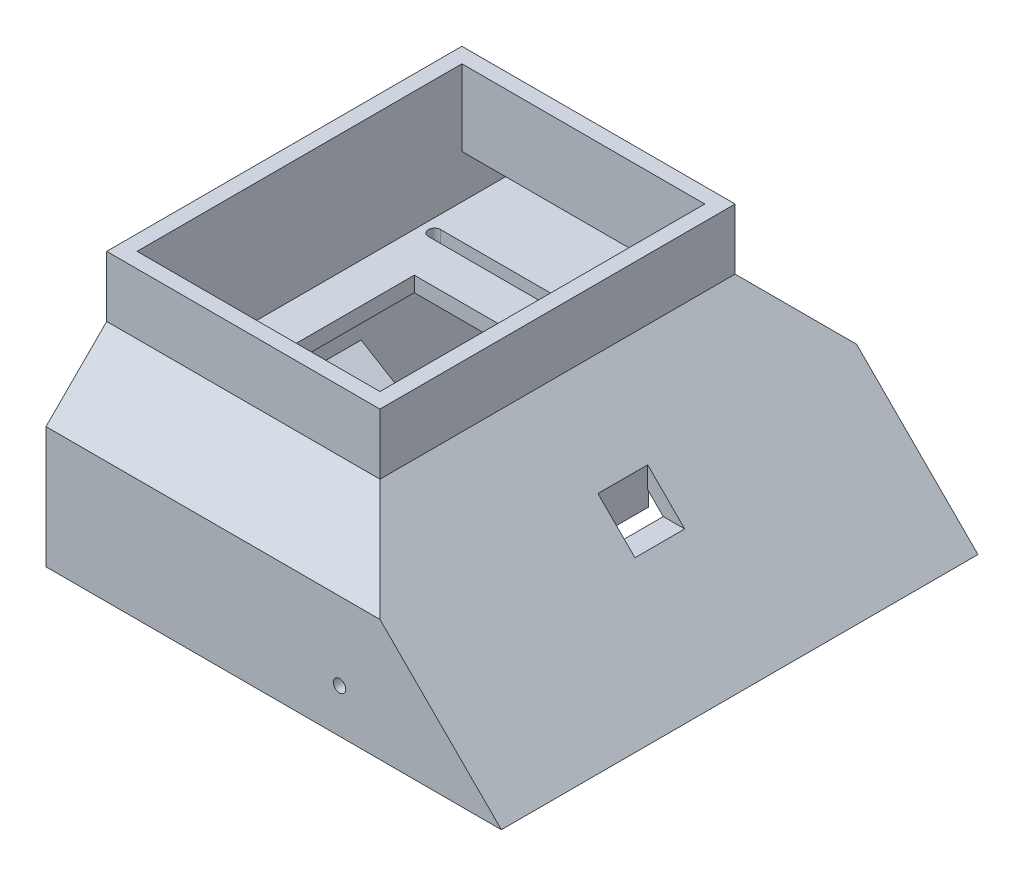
ISO-10303-21;
HEADER;
FILE_DESCRIPTION(('STEP AP214'),'2;1');
FILE_NAME('part.step','',(''),(''),'','','');
FILE_SCHEMA(('AUTOMOTIVE_DESIGN { 1 0 10303 214 1 1 1 1 }'));
ENDSEC;
DATA;
#1=APPLICATION_CONTEXT('core data for automotive mechanical design processes');
#2=APPLICATION_PROTOCOL_DEFINITION('international standard','automotive_design',2000,#1);
#3=PRODUCT_CONTEXT('',#1,'mechanical');
#4=PRODUCT('Part','Part','',(#3));
#5=PRODUCT_RELATED_PRODUCT_CATEGORY('part','',(#4));
#6=PRODUCT_DEFINITION_FORMATION('','',#4);
#7=PRODUCT_DEFINITION_CONTEXT('part definition',#1,'design');
#8=PRODUCT_DEFINITION('design','',#6,#7);
#9=PRODUCT_DEFINITION_SHAPE('','',#8);
#10=(LENGTH_UNIT() NAMED_UNIT(*) SI_UNIT(.MILLI.,.METRE.));
#11=(NAMED_UNIT(*) PLANE_ANGLE_UNIT() SI_UNIT($,.RADIAN.));
#12=(NAMED_UNIT(*) SI_UNIT($,.STERADIAN.) SOLID_ANGLE_UNIT());
#13=UNCERTAINTY_MEASURE_WITH_UNIT(LENGTH_MEASURE(1.E-05),#10,'distance_accuracy_value','');
#14=(GEOMETRIC_REPRESENTATION_CONTEXT(3) GLOBAL_UNCERTAINTY_ASSIGNED_CONTEXT((#13)) GLOBAL_UNIT_ASSIGNED_CONTEXT((#10,
#11,#12)) REPRESENTATION_CONTEXT('',''));
#15=CARTESIAN_POINT('',(0.,0.,0.));
#16=DIRECTION('',(0.,0.,1.));
#17=DIRECTION('',(1.,0.,0.));
#18=AXIS2_PLACEMENT_3D('',#15,#16,#17);
#19=CARTESIAN_POINT('',(6.35,0.,-199.39));
#20=DIRECTION('',(-1.,0.,0.));
#21=DIRECTION('',(0.,-1.,0.));
#22=AXIS2_PLACEMENT_3D('',#19,#20,#21);
#23=PLANE('',#22);
#24=DIRECTION('',(0.,1.,0.));
#25=VECTOR('',#24,1.);
#26=CARTESIAN_POINT('',(6.35000000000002,-64.9638401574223,-77.724));
#27=LINE('',#26,#25);
#28=CARTESIAN_POINT('',(6.35,0.,-77.724));
#29=VERTEX_POINT('',#28);
#30=CARTESIAN_POINT('',(6.34999999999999,22.606,-77.724));
#31=VERTEX_POINT('',#30);
#32=EDGE_CURVE('E554',#29,#31,#27,.T.);
#33=ORIENTED_EDGE('',*,*,#32,.T.);
#34=DIRECTION('',(0.,0.,1.));
#35=VECTOR('',#34,1.);
#36=CARTESIAN_POINT('',(6.34999999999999,22.606,-177.90619043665));
#37=LINE('',#36,#35);
#38=CARTESIAN_POINT('',(6.34999999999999,22.606,-125.476));
#39=VERTEX_POINT('',#38);
#40=EDGE_CURVE('E427',#39,#31,#37,.T.);
#41=ORIENTED_EDGE('',*,*,#40,.F.);
#42=DIRECTION('',(0.,1.,0.));
#43=VECTOR('',#42,1.);
#44=CARTESIAN_POINT('',(6.35000000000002,-64.9638401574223,-125.476));
#45=LINE('',#44,#43);
#46=CARTESIAN_POINT('',(6.35,0.,-125.476));
#47=VERTEX_POINT('',#46);
#48=EDGE_CURVE('E573',#47,#39,#45,.T.);
#49=ORIENTED_EDGE('',*,*,#48,.F.);
#50=DIRECTION('',(0.,0.,1.));
#51=VECTOR('',#50,1.);
#52=CARTESIAN_POINT('',(6.35,0.,-199.39));
#53=LINE('',#52,#51);
#54=CARTESIAN_POINT('',(6.35,0.,-193.04));
#55=VERTEX_POINT('',#54);
#56=EDGE_CURVE('E674',#55,#47,#53,.T.);
#57=ORIENTED_EDGE('',*,*,#56,.F.);
#58=DIRECTION('',(0.,-1.,0.));
#59=VECTOR('',#58,1.);
#60=CARTESIAN_POINT('',(6.35,0.,-193.04));
#61=LINE('',#60,#59);
#62=CARTESIAN_POINT('',(6.34999999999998,45.212,-193.04));
#63=VERTEX_POINT('',#62);
#64=EDGE_CURVE('E651',#63,#55,#61,.T.);
#65=ORIENTED_EDGE('',*,*,#64,.F.);
#66=DIRECTION('',(0.,0.,1.));
#67=VECTOR('',#66,1.);
#68=CARTESIAN_POINT('',(6.34999999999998,45.2119999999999,-199.39));
#69=LINE('',#68,#67);
#70=CARTESIAN_POINT('',(6.34999999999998,45.2119999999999,-6.35));
#71=VERTEX_POINT('',#70);
#72=EDGE_CURVE('E605',#63,#71,#69,.T.);
#73=ORIENTED_EDGE('',*,*,#72,.T.);
#74=DIRECTION('',(0.,-1.,0.));
#75=VECTOR('',#74,1.);
#76=CARTESIAN_POINT('',(6.35,0.,-6.34999999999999));
#77=LINE('',#76,#75);
#78=CARTESIAN_POINT('',(6.35,0.,-6.35));
#79=VERTEX_POINT('',#78);
#80=EDGE_CURVE('E635',#71,#79,#77,.T.);
#81=ORIENTED_EDGE('',*,*,#80,.T.);
#82=EDGE_CURVE('E678',#29,#79,#53,.T.);
#83=ORIENTED_EDGE('',*,*,#82,.F.);
#84=EDGE_LOOP('',(#33,#41,#49,#57,#65,#73,#81,#83));
#85=FACE_BOUND('',#84,.T.);
#86=ADVANCED_FACE('F37',(#85),#23,.F.);
#87=CARTESIAN_POINT('',(365.754455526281,45.2120000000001,-195.997743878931));
#88=DIRECTION('',(0.,-1.,0.));
#89=DIRECTION('',(1.,0.,0.));
#90=AXIS2_PLACEMENT_3D('',#87,#88,#89);
#91=PLANE('',#90);
#92=DIRECTION('',(1.,0.,0.));
#93=VECTOR('',#92,1.);
#94=CARTESIAN_POINT('',(22.9236072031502,45.2119999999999,-72.5368683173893));
#95=LINE('',#94,#93);
#96=CARTESIAN_POINT('',(22.9236072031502,45.2119999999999,-72.5368683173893));
#97=VERTEX_POINT('',#96);
#98=CARTESIAN_POINT('',(100.395751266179,45.2119999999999,-72.5368683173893));
#99=VERTEX_POINT('',#98);
#100=EDGE_CURVE('E365',#97,#99,#95,.T.);
#101=ORIENTED_EDGE('',*,*,#100,.T.);
#102=DIRECTION('',(0.,0.,-1.));
#103=VECTOR('',#102,1.);
#104=CARTESIAN_POINT('',(100.395751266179,45.212,-72.5368683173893));
#105=LINE('',#104,#103);
#106=CARTESIAN_POINT('',(100.395751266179,45.212,-131.141257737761));
#107=VERTEX_POINT('',#106);
#108=EDGE_CURVE('E352',#99,#107,#105,.T.);
#109=ORIENTED_EDGE('',*,*,#108,.T.);
#110=DIRECTION('',(-1.,0.,0.));
#111=VECTOR('',#110,1.);
#112=CARTESIAN_POINT('',(22.9236072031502,45.2119999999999,-131.141257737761));
#113=LINE('',#112,#111);
#114=CARTESIAN_POINT('',(22.9236072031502,45.2119999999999,-131.141257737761));
#115=VERTEX_POINT('',#114);
#116=EDGE_CURVE('E383',#107,#115,#113,.T.);
#117=ORIENTED_EDGE('',*,*,#116,.T.);
#118=DIRECTION('',(0.,0.,1.));
#119=VECTOR('',#118,1.);
#120=CARTESIAN_POINT('',(22.9236072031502,45.2119999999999,-72.5368683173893));
#121=LINE('',#120,#119);
#122=EDGE_CURVE('E373',#115,#97,#121,.T.);
#123=ORIENTED_EDGE('',*,*,#122,.T.);
#124=EDGE_LOOP('',(#101,#109,#117,#123));
#125=FACE_BOUND('',#124,.T.);
#126=DIRECTION('',(-1.,0.,0.));
#127=VECTOR('',#126,1.);
#128=CARTESIAN_POINT('',(365.754455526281,45.2120000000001,-91.186));
#129=LINE('',#128,#127);
#130=CARTESIAN_POINT('',(136.307743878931,45.212,-91.186));
#131=VERTEX_POINT('',#130);
#132=CARTESIAN_POINT('',(132.334,45.212,-91.186));
#133=VERTEX_POINT('',#132);
#134=EDGE_CURVE('E453',#131,#133,#129,.T.);
#135=ORIENTED_EDGE('',*,*,#134,.F.);
#136=DIRECTION('',(0.,0.,-1.));
#137=VECTOR('',#136,1.);
#138=CARTESIAN_POINT('',(136.307743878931,45.212,-195.997743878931));
#139=LINE('',#138,#137);
#140=CARTESIAN_POINT('',(136.307743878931,45.212,-6.35));
#141=VERTEX_POINT('',#140);
#142=EDGE_CURVE('E593',#131,#141,#139,.F.);
#143=ORIENTED_EDGE('',*,*,#142,.T.);
#144=DIRECTION('',(-1.,0.,0.));
#145=VECTOR('',#144,1.);
#146=CARTESIAN_POINT('',(0.,45.2119999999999,-6.35));
#147=LINE('',#146,#145);
#148=EDGE_CURVE('E746',#141,#71,#147,.T.);
#149=ORIENTED_EDGE('',*,*,#148,.T.);
#150=ORIENTED_EDGE('',*,*,#72,.F.);
#151=DIRECTION('',(-1.,0.,0.));
#152=VECTOR('',#151,1.);
#153=CARTESIAN_POINT('',(0.,45.2119999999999,-193.04));
#154=LINE('',#153,#152);
#155=CARTESIAN_POINT('',(136.307743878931,45.212,-193.04));
#156=VERTEX_POINT('',#155);
#157=EDGE_CURVE('E607',#156,#63,#154,.T.);
#158=ORIENTED_EDGE('',*,*,#157,.F.);
#159=CARTESIAN_POINT('',(136.307743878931,45.212,-112.323379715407));
#160=VERTEX_POINT('',#159);
#161=EDGE_CURVE('E594',#156,#160,#139,.F.);
#162=ORIENTED_EDGE('',*,*,#161,.T.);
#163=DIRECTION('',(1.,0.,0.));
#164=VECTOR('',#163,1.);
#165=CARTESIAN_POINT('',(365.754455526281,45.2120000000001,-112.323379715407));
#166=LINE('',#165,#164);
#167=CARTESIAN_POINT('',(132.334,45.212,-112.323379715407));
#168=VERTEX_POINT('',#167);
#169=EDGE_CURVE('E458',#168,#160,#166,.T.);
#170=ORIENTED_EDGE('',*,*,#169,.F.);
#171=DIRECTION('',(0.,0.,1.));
#172=VECTOR('',#171,1.);
#173=CARTESIAN_POINT('',(132.334,45.212,-195.997743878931));
#174=LINE('',#173,#172);
#175=EDGE_CURVE('E12',#168,#133,#174,.T.);
#176=ORIENTED_EDGE('',*,*,#175,.T.);
#177=EDGE_LOOP('',(#135,#143,#149,#150,#158,#162,#170,#176));
#178=FACE_BOUND('',#177,.T.);
#179=DIRECTION('',(-1.,0.,0.));
#180=VECTOR('',#179,1.);
#181=CARTESIAN_POINT('',(126.3711417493,45.212,-49.9715673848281));
#182=LINE('',#181,#180);
#183=CARTESIAN_POINT('',(126.3711417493,45.212,-49.9715673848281));
#184=VERTEX_POINT('',#183);
#185=CARTESIAN_POINT('',(12.0711417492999,45.2119999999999,-49.9715673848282));
#186=VERTEX_POINT('',#185);
#187=EDGE_CURVE('E467',#184,#186,#182,.T.);
#188=ORIENTED_EDGE('',*,*,#187,.F.);
#189=CARTESIAN_POINT('',(126.3711417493,45.212,-52.5115673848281));
#190=DIRECTION('',(0.,-1.,0.));
#191=DIRECTION('',(1.,0.,0.));
#192=AXIS2_PLACEMENT_3D('',#189,#190,#191);
#193=CIRCLE('',#192,2.54);
#194=CARTESIAN_POINT('',(126.3711417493,45.212,-55.0515673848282));
#195=VERTEX_POINT('',#194);
#196=EDGE_CURVE('E470',#195,#184,#193,.T.);
#197=ORIENTED_EDGE('',*,*,#196,.F.);
#198=DIRECTION('',(1.,0.,0.));
#199=VECTOR('',#198,1.);
#200=CARTESIAN_POINT('',(126.3711417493,45.212,-55.0515673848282));
#201=LINE('',#200,#199);
#202=CARTESIAN_POINT('',(12.0711417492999,45.2119999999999,-55.0515673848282));
#203=VERTEX_POINT('',#202);
#204=EDGE_CURVE('E461',#203,#195,#201,.T.);
#205=ORIENTED_EDGE('',*,*,#204,.F.);
#206=CARTESIAN_POINT('',(12.0711417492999,45.2119999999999,-52.5115673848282));
#207=DIRECTION('',(0.,-1.,0.));
#208=DIRECTION('',(1.,0.,0.));
#209=AXIS2_PLACEMENT_3D('',#206,#207,#208);
#210=CIRCLE('',#209,2.54);
#211=EDGE_CURVE('E464',#186,#203,#210,.T.);
#212=ORIENTED_EDGE('',*,*,#211,.F.);
#213=EDGE_LOOP('',(#188,#197,#205,#212));
#214=FACE_BOUND('',#213,.T.);
#215=DIRECTION('',(-1.,0.,0.));
#216=VECTOR('',#215,1.);
#217=CARTESIAN_POINT('',(126.216772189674,45.212,-148.093458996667));
#218=LINE('',#217,#216);
#219=CARTESIAN_POINT('',(126.216772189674,45.212,-148.093458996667));
#220=VERTEX_POINT('',#219);
#221=CARTESIAN_POINT('',(11.9167721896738,45.2119999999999,-148.093458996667));
#222=VERTEX_POINT('',#221);
#223=EDGE_CURVE('E501',#220,#222,#218,.T.);
#224=ORIENTED_EDGE('',*,*,#223,.F.);
#225=CARTESIAN_POINT('',(126.216772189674,45.212,-150.633458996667));
#226=DIRECTION('',(0.,-1.,0.));
#227=DIRECTION('',(1.,0.,0.));
#228=AXIS2_PLACEMENT_3D('',#225,#226,#227);
#229=CIRCLE('',#228,2.53999999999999);
#230=CARTESIAN_POINT('',(126.216772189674,45.212,-153.173458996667));
#231=VERTEX_POINT('',#230);
#232=EDGE_CURVE('E460',#231,#220,#229,.T.);
#233=ORIENTED_EDGE('',*,*,#232,.F.);
#234=DIRECTION('',(1.,0.,0.));
#235=VECTOR('',#234,1.);
#236=CARTESIAN_POINT('',(126.216772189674,45.212,-153.173458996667));
#237=LINE('',#236,#235);
#238=CARTESIAN_POINT('',(11.9167721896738,45.2119999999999,-153.173458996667));
#239=VERTEX_POINT('',#238);
#240=EDGE_CURVE('E495',#239,#231,#237,.T.);
#241=ORIENTED_EDGE('',*,*,#240,.F.);
#242=CARTESIAN_POINT('',(11.9167721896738,45.2119999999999,-150.633458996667));
#243=DIRECTION('',(0.,-1.,0.));
#244=DIRECTION('',(1.,0.,0.));
#245=AXIS2_PLACEMENT_3D('',#242,#243,#244);
#246=CIRCLE('',#245,2.53999999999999);
#247=EDGE_CURVE('E498',#222,#239,#246,.T.);
#248=ORIENTED_EDGE('',*,*,#247,.F.);
#249=EDGE_LOOP('',(#224,#233,#241,#248));
#250=FACE_BOUND('',#249,.T.);
#251=ADVANCED_FACE('F371',(#125,#178,#214,#250),#91,.T.);
#252=CARTESIAN_POINT('',(186.009871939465,-4.49012806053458,-199.39));
#253=DIRECTION('',(-0.707106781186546,-0.707106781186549,0.));
#254=DIRECTION('',(0.,0.,1.));
#255=AXIS2_PLACEMENT_3D('',#252,#253,#254);
#256=PLANE('',#255);
#257=DIRECTION('',(0.,0.,1.));
#258=VECTOR('',#257,1.);
#259=CARTESIAN_POINT('',(151.039743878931,30.4799999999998,-85.5598736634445));
#260=LINE('',#259,#258);
#261=CARTESIAN_POINT('',(151.039743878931,30.4799999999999,-85.5598736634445));
#262=VERTEX_POINT('',#261);
#263=CARTESIAN_POINT('',(151.039743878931,30.4799999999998,-118.579873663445));
#264=VERTEX_POINT('',#263);
#265=EDGE_CURVE('E547',#262,#264,#260,.F.);
#266=ORIENTED_EDGE('',*,*,#265,.F.);
#267=DIRECTION('',(0.707106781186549,-0.707106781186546,0.));
#268=VECTOR('',#267,1.);
#269=CARTESIAN_POINT('',(141.739891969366,39.7798519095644,-85.5598736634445));
#270=LINE('',#269,#268);
#271=CARTESIAN_POINT('',(168.819743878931,12.6999999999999,-85.5598736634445));
#272=VERTEX_POINT('',#271);
#273=EDGE_CURVE('E528',#272,#262,#270,.F.);
#274=ORIENTED_EDGE('',*,*,#273,.F.);
#275=DIRECTION('',(0.,0.,-1.));
#276=VECTOR('',#275,1.);
#277=CARTESIAN_POINT('',(168.819743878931,12.6999999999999,-85.5598736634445));
#278=LINE('',#277,#276);
#279=CARTESIAN_POINT('',(168.819743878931,12.6999999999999,-118.579873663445));
#280=VERTEX_POINT('',#279);
#281=EDGE_CURVE('E540',#280,#272,#278,.F.);
#282=ORIENTED_EDGE('',*,*,#281,.F.);
#283=DIRECTION('',(-0.707106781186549,0.707106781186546,0.));
#284=VECTOR('',#283,1.);
#285=CARTESIAN_POINT('',(141.739891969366,39.7798519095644,-118.579873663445));
#286=LINE('',#285,#284);
#287=EDGE_CURVE('E544',#264,#280,#286,.F.);
#288=ORIENTED_EDGE('',*,*,#287,.F.);
#289=EDGE_LOOP('',(#266,#274,#282,#288));
#290=FACE_BOUND('',#289,.T.);
#291=ORIENTED_EDGE('',*,*,#142,.F.);
#292=DIRECTION('',(-0.707106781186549,0.707106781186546,0.));
#293=VECTOR('',#292,1.);
#294=CARTESIAN_POINT('',(186.009871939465,-4.49012806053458,-91.186));
#295=LINE('',#294,#293);
#296=CARTESIAN_POINT('',(139.7,41.8197438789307,-91.186));
#297=VERTEX_POINT('',#296);
#298=EDGE_CURVE('E448',#131,#297,#295,.F.);
#299=ORIENTED_EDGE('',*,*,#298,.T.);
#300=DIRECTION('',(0.707106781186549,-0.707106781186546,0.));
#301=VECTOR('',#300,1.);
#302=CARTESIAN_POINT('',(186.009871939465,-4.49012806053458,-91.186));
#303=LINE('',#302,#301);
#304=CARTESIAN_POINT('',(146.213743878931,35.3060000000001,-91.186));
#305=VERTEX_POINT('',#304);
#306=EDGE_CURVE('E736',#305,#297,#303,.F.);
#307=ORIENTED_EDGE('',*,*,#306,.F.);
#308=DIRECTION('',(0.,0.,-1.));
#309=VECTOR('',#308,1.);
#310=CARTESIAN_POINT('',(146.213743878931,35.306,-199.39));
#311=LINE('',#310,#309);
#312=CARTESIAN_POINT('',(146.213743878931,35.3060000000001,-112.014));
#313=VERTEX_POINT('',#312);
#314=EDGE_CURVE('E739',#313,#305,#311,.F.);
#315=ORIENTED_EDGE('',*,*,#314,.F.);
#316=DIRECTION('',(-0.707106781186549,0.707106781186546,0.));
#317=VECTOR('',#316,1.);
#318=CARTESIAN_POINT('',(186.009871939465,-4.49012806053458,-112.014));
#319=LINE('',#318,#317);
#320=CARTESIAN_POINT('',(139.7,41.8197438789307,-112.014));
#321=VERTEX_POINT('',#320);
#322=EDGE_CURVE('E741',#321,#313,#319,.F.);
#323=ORIENTED_EDGE('',*,*,#322,.F.);
#324=DIRECTION('',(0.,0.,1.));
#325=VECTOR('',#324,1.);
#326=CARTESIAN_POINT('',(139.7,41.8197438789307,-199.39));
#327=LINE('',#326,#325);
#328=CARTESIAN_POINT('',(139.7,41.8197438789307,-112.323379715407));
#329=VERTEX_POINT('',#328);
#330=EDGE_CURVE('E455',#321,#329,#327,.F.);
#331=ORIENTED_EDGE('',*,*,#330,.T.);
#332=DIRECTION('',(0.707106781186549,-0.707106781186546,0.));
#333=VECTOR('',#332,1.);
#334=CARTESIAN_POINT('',(186.009871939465,-4.49012806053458,-112.323379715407));
#335=LINE('',#334,#333);
#336=EDGE_CURVE('E45',#329,#160,#335,.F.);
#337=ORIENTED_EDGE('',*,*,#336,.T.);
#338=ORIENTED_EDGE('',*,*,#161,.F.);
#339=DIRECTION('',(-0.707106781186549,0.707106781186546,0.));
#340=VECTOR('',#339,1.);
#341=CARTESIAN_POINT('',(90.7598719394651,90.7598719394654,-193.04));
#342=LINE('',#341,#340);
#343=CARTESIAN_POINT('',(181.519743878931,0.,-193.04));
#344=VERTEX_POINT('',#343);
#345=EDGE_CURVE('E668',#156,#344,#342,.F.);
#346=ORIENTED_EDGE('',*,*,#345,.T.);
#347=DIRECTION('',(0.,0.,-1.));
#348=VECTOR('',#347,1.);
#349=CARTESIAN_POINT('',(181.519743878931,0.,-199.39));
#350=LINE('',#349,#348);
#351=CARTESIAN_POINT('',(181.519743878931,0.,-6.35));
#352=VERTEX_POINT('',#351);
#353=EDGE_CURVE('E677',#344,#352,#350,.F.);
#354=ORIENTED_EDGE('',*,*,#353,.T.);
#355=DIRECTION('',(0.707106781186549,-0.707106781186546,0.));
#356=VECTOR('',#355,1.);
#357=CARTESIAN_POINT('',(186.009871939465,-4.49012806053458,-6.34999999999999));
#358=LINE('',#357,#356);
#359=EDGE_CURVE('E649',#352,#141,#358,.F.);
#360=ORIENTED_EDGE('',*,*,#359,.T.);
#361=EDGE_LOOP('',(#291,#299,#307,#315,#323,#331,#337,#338,#346,#354,#360));
#362=FACE_BOUND('',#361,.T.);
#363=ADVANCED_FACE('F754',(#290,#362),#256,.T.);
#364=CARTESIAN_POINT('',(190.5,0.,-199.39));
#365=DIRECTION('',(-0.707106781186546,-0.707106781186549,0.));
#366=DIRECTION('',(0.,0.,1.));
#367=AXIS2_PLACEMENT_3D('',#364,#365,#366);
#368=PLANE('',#367);
#369=DIRECTION('',(0.577350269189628,-0.577350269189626,-0.577350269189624));
#370=VECTOR('',#369,1.);
#371=CARTESIAN_POINT('',(76.1999999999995,114.3,-135.89));
#372=LINE('',#371,#370);
#373=CARTESIAN_POINT('',(114.3,76.2,-173.99));
#374=VERTEX_POINT('',#373);
#375=CARTESIAN_POINT('',(139.7,50.7999999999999,-199.39));
#376=VERTEX_POINT('',#375);
#377=EDGE_CURVE('E723',#374,#376,#372,.T.);
#378=ORIENTED_EDGE('',*,*,#377,.F.);
#379=DIRECTION('',(0.,0.,-1.));
#380=VECTOR('',#379,1.);
#381=CARTESIAN_POINT('',(114.3,76.2,-199.39));
#382=LINE('',#381,#380);
#383=CARTESIAN_POINT('',(114.3,76.2,-25.4000000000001));
#384=VERTEX_POINT('',#383);
#385=EDGE_CURVE('E720',#384,#374,#382,.T.);
#386=ORIENTED_EDGE('',*,*,#385,.F.);
#387=DIRECTION('',(0.577350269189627,-0.577350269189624,0.577350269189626));
#388=VECTOR('',#387,1.);
#389=CARTESIAN_POINT('',(93.1333333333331,97.3666666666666,-46.5666666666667));
#390=LINE('',#389,#388);
#391=CARTESIAN_POINT('',(139.7,50.8,0.));
#392=VERTEX_POINT('',#391);
#393=EDGE_CURVE('E718',#392,#384,#390,.F.);
#394=ORIENTED_EDGE('',*,*,#393,.F.);
#395=DIRECTION('',(0.707106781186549,-0.707106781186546,0.));
#396=VECTOR('',#395,1.);
#397=CARTESIAN_POINT('',(190.5,0.,0.));
#398=LINE('',#397,#396);
#399=CARTESIAN_POINT('',(190.5,0.,0.));
#400=VERTEX_POINT('',#399);
#401=EDGE_CURVE('E716',#400,#392,#398,.F.);
#402=ORIENTED_EDGE('',*,*,#401,.F.);
#403=DIRECTION('',(0.,0.,1.));
#404=VECTOR('',#403,1.);
#405=CARTESIAN_POINT('',(190.5,0.,-199.39));
#406=LINE('',#405,#404);
#407=CARTESIAN_POINT('',(190.5,0.,-199.39));
#408=VERTEX_POINT('',#407);
#409=EDGE_CURVE('E695',#408,#400,#406,.T.);
#410=ORIENTED_EDGE('',*,*,#409,.F.);
#411=DIRECTION('',(-0.707106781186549,0.707106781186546,0.));
#412=VECTOR('',#411,1.);
#413=CARTESIAN_POINT('',(95.2499999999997,95.25,-199.39));
#414=LINE('',#413,#412);
#415=EDGE_CURVE('E725',#376,#408,#414,.F.);
#416=ORIENTED_EDGE('',*,*,#415,.F.);
#417=EDGE_LOOP('',(#378,#386,#394,#402,#410,#416));
#418=FACE_BOUND('',#417,.T.);
#419=DIRECTION('',(0.,0.,-1.));
#420=VECTOR('',#419,1.);
#421=CARTESIAN_POINT('',(139.7,50.7999999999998,-199.39));
#422=LINE('',#421,#420);
#423=CARTESIAN_POINT('',(139.7,50.7999999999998,-112.014));
#424=VERTEX_POINT('',#423);
#425=CARTESIAN_POINT('',(139.7,50.7999999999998,-91.186));
#426=VERTEX_POINT('',#425);
#427=EDGE_CURVE('E621',#424,#426,#422,.F.);
#428=ORIENTED_EDGE('',*,*,#427,.F.);
#429=DIRECTION('',(-0.707106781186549,0.707106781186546,0.));
#430=VECTOR('',#429,1.);
#431=CARTESIAN_POINT('',(190.5,0.,-112.014));
#432=LINE('',#431,#430);
#433=CARTESIAN_POINT('',(155.194,35.3060000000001,-112.014));
#434=VERTEX_POINT('',#433);
#435=EDGE_CURVE('E629',#424,#434,#432,.F.);
#436=ORIENTED_EDGE('',*,*,#435,.T.);
#437=DIRECTION('',(0.,0.,-1.));
#438=VECTOR('',#437,1.);
#439=CARTESIAN_POINT('',(155.194,35.306,-199.39));
#440=LINE('',#439,#438);
#441=CARTESIAN_POINT('',(155.194,35.3060000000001,-91.186));
#442=VERTEX_POINT('',#441);
#443=EDGE_CURVE('E626',#434,#442,#440,.F.);
#444=ORIENTED_EDGE('',*,*,#443,.T.);
#445=DIRECTION('',(0.707106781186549,-0.707106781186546,0.));
#446=VECTOR('',#445,1.);
#447=CARTESIAN_POINT('',(190.5,0.,-91.186));
#448=LINE('',#447,#446);
#449=EDGE_CURVE('E623',#442,#426,#448,.F.);
#450=ORIENTED_EDGE('',*,*,#449,.T.);
#451=EDGE_LOOP('',(#428,#436,#444,#450));
#452=FACE_BOUND('',#451,.T.);
#453=ADVANCED_FACE('F39',(#418,#452),#368,.F.);
#454=DIRECTION('',(0.577350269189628,-0.577350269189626,-0.577350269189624));
#455=VECTOR('',#454,1.);
#456=CARTESIAN_POINT('',(73.2065812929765,108.313162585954,-132.896581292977));
#457=LINE('',#456,#455);
#458=CARTESIAN_POINT('',(111.669743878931,69.85,-171.359743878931));
#459=VERTEX_POINT('',#458);
#460=CARTESIAN_POINT('',(129.957743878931,51.562,-189.647743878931));
#461=VERTEX_POINT('',#460);
#462=EDGE_CURVE('E663',#459,#461,#457,.T.);
#463=ORIENTED_EDGE('',*,*,#462,.T.);
#464=DIRECTION('',(0.,0.,1.));
#465=VECTOR('',#464,1.);
#466=CARTESIAN_POINT('',(129.957743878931,51.562,-195.997743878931));
#467=LINE('',#466,#465);
#468=CARTESIAN_POINT('',(129.957743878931,51.562,-9.7422561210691));
#469=VERTEX_POINT('',#468);
#470=EDGE_CURVE('E597',#469,#461,#467,.F.);
#471=ORIENTED_EDGE('',*,*,#470,.F.);
#472=DIRECTION('',(0.577350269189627,-0.577350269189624,0.577350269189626));
#473=VECTOR('',#472,1.);
#474=CARTESIAN_POINT('',(90.13991462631,91.3798292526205,-49.5600853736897));
#475=LINE('',#474,#473);
#476=CARTESIAN_POINT('',(111.669743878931,69.85,-28.0302561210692));
#477=VERTEX_POINT('',#476);
#478=EDGE_CURVE('E664',#469,#477,#475,.F.);
#479=ORIENTED_EDGE('',*,*,#478,.T.);
#480=DIRECTION('',(0.,0.,1.));
#481=VECTOR('',#480,1.);
#482=CARTESIAN_POINT('',(111.669743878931,69.85,-199.39));
#483=LINE('',#482,#481);
#484=EDGE_CURVE('E661',#477,#459,#483,.F.);
#485=ORIENTED_EDGE('',*,*,#484,.T.);
#486=EDGE_LOOP('',(#463,#471,#479,#485));
#487=FACE_BOUND('',#486,.T.);
#488=ADVANCED_FACE('F857',(#487),#256,.T.);
#489=CARTESIAN_POINT('',(0.,0.,-199.39));
#490=DIRECTION('',(0.,-1.,0.));
#491=DIRECTION('',(0.,0.,-1.));
#492=AXIS2_PLACEMENT_3D('',#489,#490,#491);
#493=PLANE('',#492);
#494=DIRECTION('',(1.,0.,0.));
#495=VECTOR('',#494,1.);
#496=CARTESIAN_POINT('',(0.,0.,0.));
#497=LINE('',#496,#495);
#498=CARTESIAN_POINT('',(0.,0.,0.));
#499=VERTEX_POINT('',#498);
#500=EDGE_CURVE('E688',#499,#400,#497,.T.);
#501=ORIENTED_EDGE('',*,*,#500,.F.);
#502=DIRECTION('',(0.,0.,1.));
#503=VECTOR('',#502,1.);
#504=CARTESIAN_POINT('',(0.,0.,-199.39));
#505=LINE('',#504,#503);
#506=CARTESIAN_POINT('',(0.,0.,-199.39));
#507=VERTEX_POINT('',#506);
#508=EDGE_CURVE('E691',#507,#499,#505,.T.);
#509=ORIENTED_EDGE('',*,*,#508,.F.);
#510=DIRECTION('',(1.,0.,0.));
#511=VECTOR('',#510,1.);
#512=CARTESIAN_POINT('',(0.,0.,-199.39));
#513=LINE('',#512,#511);
#514=EDGE_CURVE('E687',#507,#408,#513,.T.);
#515=ORIENTED_EDGE('',*,*,#514,.T.);
#516=ORIENTED_EDGE('',*,*,#409,.T.);
#517=EDGE_LOOP('',(#501,#509,#515,#516));
#518=FACE_BOUND('',#517,.T.);
#519=ORIENTED_EDGE('',*,*,#56,.T.);
#520=DIRECTION('',(0.,0.,1.));
#521=VECTOR('',#520,1.);
#522=CARTESIAN_POINT('',(6.35,0.,-199.39));
#523=LINE('',#522,#521);
#524=EDGE_CURVE('E558',#47,#29,#523,.T.);
#525=ORIENTED_EDGE('',*,*,#524,.T.);
#526=ORIENTED_EDGE('',*,*,#82,.T.);
#527=DIRECTION('',(1.,0.,0.));
#528=VECTOR('',#527,1.);
#529=CARTESIAN_POINT('',(0.,0.,-6.34999999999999));
#530=LINE('',#529,#528);
#531=EDGE_CURVE('E654',#79,#352,#530,.T.);
#532=ORIENTED_EDGE('',*,*,#531,.T.);
#533=ORIENTED_EDGE('',*,*,#353,.F.);
#534=DIRECTION('',(1.,0.,0.));
#535=VECTOR('',#534,1.);
#536=CARTESIAN_POINT('',(0.,0.,-193.04));
#537=LINE('',#536,#535);
#538=EDGE_CURVE('E653',#55,#344,#537,.T.);
#539=ORIENTED_EDGE('',*,*,#538,.F.);
#540=EDGE_LOOP('',(#519,#525,#526,#532,#533,#539));
#541=FACE_BOUND('',#540,.T.);
#542=ADVANCED_FACE('F777',(#518,#541),#493,.T.);
#543=CARTESIAN_POINT('',(0.,0.,-199.39));
#544=DIRECTION('',(-1.,0.,0.));
#545=DIRECTION('',(0.,-1.,0.));
#546=AXIS2_PLACEMENT_3D('',#543,#544,#545);
#547=PLANE('',#546);
#548=DIRECTION('',(0.,0.707106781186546,-0.707106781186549));
#549=VECTOR('',#548,1.);
#550=CARTESIAN_POINT('',(0.,125.095,-74.2950000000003));
#551=LINE('',#550,#549);
#552=CARTESIAN_POINT('',(0.,50.8,0.));
#553=VERTEX_POINT('',#552);
#554=CARTESIAN_POINT('',(0.,76.2,-25.4000000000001));
#555=VERTEX_POINT('',#554);
#556=EDGE_CURVE('E706',#553,#555,#551,.T.);
#557=ORIENTED_EDGE('',*,*,#556,.T.);
#558=DIRECTION('',(0.,-1.,0.));
#559=VECTOR('',#558,1.);
#560=CARTESIAN_POINT('',(0.,101.6,-25.4000000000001));
#561=LINE('',#560,#559);
#562=CARTESIAN_POINT('',(0.,101.6,-25.4000000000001));
#563=VERTEX_POINT('',#562);
#564=EDGE_CURVE('E418',#563,#555,#561,.T.);
#565=ORIENTED_EDGE('',*,*,#564,.F.);
#566=DIRECTION('',(0.,0.,1.));
#567=VECTOR('',#566,1.);
#568=CARTESIAN_POINT('',(0.,101.6,-173.99));
#569=LINE('',#568,#567);
#570=CARTESIAN_POINT('',(0.,101.6,-173.99));
#571=VERTEX_POINT('',#570);
#572=EDGE_CURVE('E400',#571,#563,#569,.T.);
#573=ORIENTED_EDGE('',*,*,#572,.F.);
#574=DIRECTION('',(0.,-1.,0.));
#575=VECTOR('',#574,1.);
#576=CARTESIAN_POINT('',(0.,101.6,-173.99));
#577=LINE('',#576,#575);
#578=CARTESIAN_POINT('',(0.,76.2,-173.99));
#579=VERTEX_POINT('',#578);
#580=EDGE_CURVE('E409',#571,#579,#577,.T.);
#581=ORIENTED_EDGE('',*,*,#580,.T.);
#582=DIRECTION('',(0.,0.707106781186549,0.707106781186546));
#583=VECTOR('',#582,1.);
#584=CARTESIAN_POINT('',(0.,25.3999999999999,-224.79));
#585=LINE('',#584,#583);
#586=CARTESIAN_POINT('',(0.,50.7999999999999,-199.39));
#587=VERTEX_POINT('',#586);
#588=EDGE_CURVE('E709',#579,#587,#585,.F.);
#589=ORIENTED_EDGE('',*,*,#588,.T.);
#590=DIRECTION('',(0.,-1.,0.));
#591=VECTOR('',#590,1.);
#592=CARTESIAN_POINT('',(0.,0.,-199.39));
#593=LINE('',#592,#591);
#594=EDGE_CURVE('E685',#587,#507,#593,.T.);
#595=ORIENTED_EDGE('',*,*,#594,.T.);
#596=ORIENTED_EDGE('',*,*,#508,.T.);
#597=DIRECTION('',(0.,-1.,0.));
#598=VECTOR('',#597,1.);
#599=CARTESIAN_POINT('',(0.,0.,0.));
#600=LINE('',#599,#598);
#601=EDGE_CURVE('E670',#553,#499,#600,.T.);
#602=ORIENTED_EDGE('',*,*,#601,.F.);
#603=EDGE_LOOP('',(#557,#565,#573,#581,#589,#595,#596,#602));
#604=FACE_BOUND('',#603,.T.);
#605=ADVANCED_FACE('F1070',(#604),#547,.T.);
#606=CARTESIAN_POINT('',(0.,0.,-199.39));
#607=DIRECTION('',(0.,0.,-1.));
#608=DIRECTION('',(-1.,0.,0.));
#609=AXIS2_PLACEMENT_3D('',#606,#607,#608);
#610=PLANE('',#609);
#611=CARTESIAN_POINT('',(122.795191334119,18.3134,-199.39));
#612=DIRECTION('',(0.,0.,1.));
#613=DIRECTION('',(1.,0.,0.));
#614=AXIS2_PLACEMENT_3D('',#611,#612,#613);
#615=CIRCLE('',#614,2.60350000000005);
#616=CARTESIAN_POINT('',(125.39869133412,18.3134,-199.39));
#617=VERTEX_POINT('',#616);
#618=EDGE_CURVE('E584',#617,#617,#615,.T.);
#619=ORIENTED_EDGE('',*,*,#618,.T.);
#620=EDGE_LOOP('',(#619));
#621=FACE_BOUND('',#620,.T.);
#622=DIRECTION('',(1.,0.,0.));
#623=VECTOR('',#622,1.);
#624=CARTESIAN_POINT('',(0.,50.7999999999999,-199.39));
#625=LINE('',#624,#623);
#626=EDGE_CURVE('E711',#587,#376,#625,.T.);
#627=ORIENTED_EDGE('',*,*,#626,.T.);
#628=ORIENTED_EDGE('',*,*,#415,.T.);
#629=ORIENTED_EDGE('',*,*,#514,.F.);
#630=ORIENTED_EDGE('',*,*,#594,.F.);
#631=EDGE_LOOP('',(#627,#628,#629,#630));
#632=FACE_BOUND('',#631,.T.);
#633=ADVANCED_FACE('F1073',(#621,#632),#610,.T.);
#634=CARTESIAN_POINT('',(0.,0.,0.));
#635=DIRECTION('',(0.,0.,-1.));
#636=DIRECTION('',(-1.,0.,0.));
#637=AXIS2_PLACEMENT_3D('',#634,#635,#636);
#638=PLANE('',#637);
#639=CARTESIAN_POINT('',(122.795191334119,18.3134,0.));
#640=DIRECTION('',(0.,0.,1.));
#641=DIRECTION('',(1.,0.,0.));
#642=AXIS2_PLACEMENT_3D('',#639,#640,#641);
#643=CIRCLE('',#642,2.60350000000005);
#644=CARTESIAN_POINT('',(125.39869133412,18.3134,0.));
#645=VERTEX_POINT('',#644);
#646=EDGE_CURVE('E583',#645,#645,#643,.T.);
#647=ORIENTED_EDGE('',*,*,#646,.F.);
#648=EDGE_LOOP('',(#647));
#649=FACE_BOUND('',#648,.T.);
#650=ORIENTED_EDGE('',*,*,#500,.T.);
#651=ORIENTED_EDGE('',*,*,#401,.T.);
#652=DIRECTION('',(-1.,0.,0.));
#653=VECTOR('',#652,1.);
#654=CARTESIAN_POINT('',(0.,50.8,0.));
#655=LINE('',#654,#653);
#656=EDGE_CURVE('E714',#392,#553,#655,.T.);
#657=ORIENTED_EDGE('',*,*,#656,.T.);
#658=ORIENTED_EDGE('',*,*,#601,.T.);
#659=EDGE_LOOP('',(#650,#651,#657,#658));
#660=FACE_BOUND('',#659,.T.);
#661=ADVANCED_FACE('F1083',(#649,#660),#638,.F.);
#662=CARTESIAN_POINT('',(0.,76.2,-173.99));
#663=DIRECTION('',(0.,-0.707106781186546,0.707106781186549));
#664=DIRECTION('',(-1.,0.,0.));
#665=AXIS2_PLACEMENT_3D('',#662,#663,#664);
#666=PLANE('',#665);
#667=DIRECTION('',(-1.,0.,0.));
#668=VECTOR('',#667,1.);
#669=CARTESIAN_POINT('',(0.,76.2,-173.99));
#670=LINE('',#669,#668);
#671=EDGE_CURVE('E703',#374,#579,#670,.T.);
#672=ORIENTED_EDGE('',*,*,#671,.F.);
#673=ORIENTED_EDGE('',*,*,#377,.T.);
#674=ORIENTED_EDGE('',*,*,#626,.F.);
#675=ORIENTED_EDGE('',*,*,#588,.F.);
#676=EDGE_LOOP('',(#672,#673,#674,#675));
#677=FACE_BOUND('',#676,.T.);
#678=ADVANCED_FACE('F841',(#677),#666,.F.);
#679=CARTESIAN_POINT('',(0.,50.8,0.));
#680=DIRECTION('',(0.,0.707106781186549,0.707106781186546));
#681=DIRECTION('',(1.,0.,0.));
#682=AXIS2_PLACEMENT_3D('',#679,#680,#681);
#683=PLANE('',#682);
#684=ORIENTED_EDGE('',*,*,#656,.F.);
#685=ORIENTED_EDGE('',*,*,#393,.T.);
#686=DIRECTION('',(1.,0.,0.));
#687=VECTOR('',#686,1.);
#688=CARTESIAN_POINT('',(190.5,76.2,-25.4000000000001));
#689=LINE('',#688,#687);
#690=EDGE_CURVE('E698',#555,#384,#689,.T.);
#691=ORIENTED_EDGE('',*,*,#690,.F.);
#692=ORIENTED_EDGE('',*,*,#556,.F.);
#693=EDGE_LOOP('',(#684,#685,#691,#692));
#694=FACE_BOUND('',#693,.T.);
#695=ADVANCED_FACE('F832',(#694),#683,.T.);
#696=DIRECTION('',(0.,0.707106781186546,-0.707106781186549));
#697=VECTOR('',#696,1.);
#698=CARTESIAN_POINT('',(6.34999999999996,120.604871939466,-78.7851280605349));
#699=LINE('',#698,#697);
#700=CARTESIAN_POINT('',(6.34999999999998,51.562,-9.7422561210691));
#701=VERTEX_POINT('',#700);
#702=CARTESIAN_POINT('',(6.34999999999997,69.85,-28.0302561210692));
#703=VERTEX_POINT('',#702);
#704=EDGE_CURVE('E650',#701,#703,#699,.T.);
#705=ORIENTED_EDGE('',*,*,#704,.F.);
#706=DIRECTION('',(0.,0.,-1.));
#707=VECTOR('',#706,1.);
#708=CARTESIAN_POINT('',(6.34999999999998,51.5619999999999,-199.39));
#709=LINE('',#708,#707);
#710=CARTESIAN_POINT('',(6.34999999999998,51.5619999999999,-189.647743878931));
#711=VERTEX_POINT('',#710);
#712=EDGE_CURVE('E599',#701,#711,#709,.T.);
#713=ORIENTED_EDGE('',*,*,#712,.T.);
#714=DIRECTION('',(0.,0.707106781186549,0.707106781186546));
#715=VECTOR('',#714,1.);
#716=CARTESIAN_POINT('',(6.34999999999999,20.9098719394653,-220.299871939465));
#717=LINE('',#716,#715);
#718=CARTESIAN_POINT('',(6.34999999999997,69.85,-171.359743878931));
#719=VERTEX_POINT('',#718);
#720=EDGE_CURVE('E646',#719,#711,#717,.F.);
#721=ORIENTED_EDGE('',*,*,#720,.F.);
#722=DIRECTION('',(0.,0.,1.));
#723=VECTOR('',#722,1.);
#724=CARTESIAN_POINT('',(6.34999999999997,69.85,-199.39));
#725=LINE('',#724,#723);
#726=CARTESIAN_POINT('',(6.35,69.85,-167.64));
#727=VERTEX_POINT('',#726);
#728=EDGE_CURVE('E641',#719,#727,#725,.T.);
#729=ORIENTED_EDGE('',*,*,#728,.T.);
#730=DIRECTION('',(0.,1.,0.));
#731=VECTOR('',#730,1.);
#732=CARTESIAN_POINT('',(6.35,0.,-167.64));
#733=LINE('',#732,#731);
#734=CARTESIAN_POINT('',(6.35,101.6,-167.64));
#735=VERTEX_POINT('',#734);
#736=EDGE_CURVE('E633',#727,#735,#733,.T.);
#737=ORIENTED_EDGE('',*,*,#736,.T.);
#738=DIRECTION('',(0.,0.,1.));
#739=VECTOR('',#738,1.);
#740=CARTESIAN_POINT('',(6.35,101.6,-31.7500000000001));
#741=LINE('',#740,#739);
#742=CARTESIAN_POINT('',(6.35,101.6,-31.7500000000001));
#743=VERTEX_POINT('',#742);
#744=EDGE_CURVE('E394',#735,#743,#741,.T.);
#745=ORIENTED_EDGE('',*,*,#744,.T.);
#746=DIRECTION('',(0.,1.,0.));
#747=VECTOR('',#746,1.);
#748=CARTESIAN_POINT('',(6.35000000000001,0.,-31.7500000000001));
#749=LINE('',#748,#747);
#750=CARTESIAN_POINT('',(6.35000000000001,69.85,-31.7500000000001));
#751=VERTEX_POINT('',#750);
#752=EDGE_CURVE('E632',#751,#743,#749,.T.);
#753=ORIENTED_EDGE('',*,*,#752,.F.);
#754=EDGE_CURVE('E645',#751,#703,#725,.T.);
#755=ORIENTED_EDGE('',*,*,#754,.T.);
#756=EDGE_LOOP('',(#705,#713,#721,#729,#737,#745,#753,#755));
#757=FACE_BOUND('',#756,.T.);
#758=ADVANCED_FACE('F822',(#757),#23,.F.);
#759=CARTESIAN_POINT('',(0.,69.85,-199.39));
#760=DIRECTION('',(0.,1.,0.));
#761=DIRECTION('',(0.,0.,1.));
#762=AXIS2_PLACEMENT_3D('',#759,#760,#761);
#763=PLANE('',#762);
#764=DIRECTION('',(0.,0.,-1.));
#765=VECTOR('',#764,1.);
#766=CARTESIAN_POINT('',(107.95,69.85,-199.39));
#767=LINE('',#766,#765);
#768=CARTESIAN_POINT('',(107.95,69.85,-31.7500000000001));
#769=VERTEX_POINT('',#768);
#770=CARTESIAN_POINT('',(107.95,69.85,-167.64));
#771=VERTEX_POINT('',#770);
#772=EDGE_CURVE('E730',#769,#771,#767,.T.);
#773=ORIENTED_EDGE('',*,*,#772,.T.);
#774=DIRECTION('',(-1.,0.,0.));
#775=VECTOR('',#774,1.);
#776=CARTESIAN_POINT('',(0.,69.85,-167.64));
#777=LINE('',#776,#775);
#778=EDGE_CURVE('E733',#771,#727,#777,.T.);
#779=ORIENTED_EDGE('',*,*,#778,.T.);
#780=ORIENTED_EDGE('',*,*,#728,.F.);
#781=DIRECTION('',(1.,0.,0.));
#782=VECTOR('',#781,1.);
#783=CARTESIAN_POINT('',(0.,69.85,-171.359743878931));
#784=LINE('',#783,#782);
#785=EDGE_CURVE('E658',#459,#719,#784,.F.);
#786=ORIENTED_EDGE('',*,*,#785,.F.);
#787=ORIENTED_EDGE('',*,*,#484,.F.);
#788=DIRECTION('',(1.,0.,0.));
#789=VECTOR('',#788,1.);
#790=CARTESIAN_POINT('',(0.,69.85,-28.0302561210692));
#791=LINE('',#790,#789);
#792=EDGE_CURVE('E644',#703,#477,#791,.T.);
#793=ORIENTED_EDGE('',*,*,#792,.F.);
#794=ORIENTED_EDGE('',*,*,#754,.F.);
#795=DIRECTION('',(1.,0.,0.));
#796=VECTOR('',#795,1.);
#797=CARTESIAN_POINT('',(0.,69.85,-31.7500000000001));
#798=LINE('',#797,#796);
#799=EDGE_CURVE('E727',#751,#769,#798,.T.);
#800=ORIENTED_EDGE('',*,*,#799,.T.);
#801=EDGE_LOOP('',(#773,#779,#780,#786,#787,#793,#794,#800));
#802=FACE_BOUND('',#801,.T.);
#803=ADVANCED_FACE('F831',(#802),#763,.F.);
#804=CARTESIAN_POINT('',(0.,0.,-193.04));
#805=DIRECTION('',(0.,0.,-1.));
#806=DIRECTION('',(-1.,0.,0.));
#807=AXIS2_PLACEMENT_3D('',#804,#805,#806);
#808=PLANE('',#807);
#809=CARTESIAN_POINT('',(122.795191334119,18.3134,-193.04));
#810=DIRECTION('',(0.,0.,-1.));
#811=DIRECTION('',(-1.,0.,0.));
#812=AXIS2_PLACEMENT_3D('',#809,#810,#811);
#813=CIRCLE('',#812,2.60350000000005);
#814=CARTESIAN_POINT('',(120.191691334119,18.3134,-193.04));
#815=VERTEX_POINT('',#814);
#816=EDGE_CURVE('E590',#815,#815,#813,.T.);
#817=ORIENTED_EDGE('',*,*,#816,.T.);
#818=EDGE_LOOP('',(#817));
#819=FACE_BOUND('',#818,.T.);
#820=ORIENTED_EDGE('',*,*,#345,.F.);
#821=ORIENTED_EDGE('',*,*,#157,.T.);
#822=ORIENTED_EDGE('',*,*,#64,.T.);
#823=ORIENTED_EDGE('',*,*,#538,.T.);
#824=EDGE_LOOP('',(#820,#821,#822,#823));
#825=FACE_BOUND('',#824,.T.);
#826=ADVANCED_FACE('F766',(#819,#825),#808,.F.);
#827=CARTESIAN_POINT('',(0.,0.,-6.35));
#828=DIRECTION('',(0.,0.,-1.));
#829=DIRECTION('',(-1.,0.,0.));
#830=AXIS2_PLACEMENT_3D('',#827,#828,#829);
#831=PLANE('',#830);
#832=CARTESIAN_POINT('',(122.795191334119,18.3134,-6.34999999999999));
#833=DIRECTION('',(0.,0.,-1.));
#834=DIRECTION('',(-1.,0.,0.));
#835=AXIS2_PLACEMENT_3D('',#832,#833,#834);
#836=CIRCLE('',#835,2.60350000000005);
#837=CARTESIAN_POINT('',(120.191691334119,18.3134,-6.34999999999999));
#838=VERTEX_POINT('',#837);
#839=EDGE_CURVE('E587',#838,#838,#836,.T.);
#840=ORIENTED_EDGE('',*,*,#839,.F.);
#841=EDGE_LOOP('',(#840));
#842=FACE_BOUND('',#841,.T.);
#843=ORIENTED_EDGE('',*,*,#148,.F.);
#844=ORIENTED_EDGE('',*,*,#359,.F.);
#845=ORIENTED_EDGE('',*,*,#531,.F.);
#846=ORIENTED_EDGE('',*,*,#80,.F.);
#847=EDGE_LOOP('',(#843,#844,#845,#846));
#848=FACE_BOUND('',#847,.T.);
#849=ADVANCED_FACE('F781',(#842,#848),#831,.T.);
#850=CARTESIAN_POINT('',(0.,71.7098719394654,-169.499871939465));
#851=DIRECTION('',(0.,-0.707106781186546,0.707106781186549));
#852=DIRECTION('',(-1.,0.,0.));
#853=AXIS2_PLACEMENT_3D('',#850,#851,#852);
#854=PLANE('',#853);
#855=ORIENTED_EDGE('',*,*,#720,.T.);
#856=DIRECTION('',(-1.,0.,0.));
#857=VECTOR('',#856,1.);
#858=CARTESIAN_POINT('',(0.,51.5619999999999,-189.647743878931));
#859=LINE('',#858,#857);
#860=EDGE_CURVE('E602',#711,#461,#859,.F.);
#861=ORIENTED_EDGE('',*,*,#860,.T.);
#862=ORIENTED_EDGE('',*,*,#462,.F.);
#863=ORIENTED_EDGE('',*,*,#785,.T.);
#864=EDGE_LOOP('',(#855,#861,#862,#863));
#865=FACE_BOUND('',#864,.T.);
#866=ADVANCED_FACE('F861',(#865),#854,.T.);
#867=CARTESIAN_POINT('',(0.,46.3098719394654,-4.49012806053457));
#868=DIRECTION('',(0.,0.707106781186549,0.707106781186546));
#869=DIRECTION('',(1.,0.,0.));
#870=AXIS2_PLACEMENT_3D('',#867,#868,#869);
#871=PLANE('',#870);
#872=ORIENTED_EDGE('',*,*,#478,.F.);
#873=DIRECTION('',(-1.,0.,0.));
#874=VECTOR('',#873,1.);
#875=CARTESIAN_POINT('',(0.,51.5619999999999,-9.74225612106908));
#876=LINE('',#875,#874);
#877=EDGE_CURVE('E743',#469,#701,#876,.T.);
#878=ORIENTED_EDGE('',*,*,#877,.T.);
#879=ORIENTED_EDGE('',*,*,#704,.T.);
#880=ORIENTED_EDGE('',*,*,#792,.T.);
#881=EDGE_LOOP('',(#872,#878,#879,#880));
#882=FACE_BOUND('',#881,.T.);
#883=ADVANCED_FACE('F851',(#882),#871,.F.);
#884=CARTESIAN_POINT('',(107.95,0.,-167.64));
#885=DIRECTION('',(0.,0.,-1.));
#886=DIRECTION('',(-1.,0.,0.));
#887=AXIS2_PLACEMENT_3D('',#884,#885,#886);
#888=PLANE('',#887);
#889=DIRECTION('',(0.,1.,0.));
#890=VECTOR('',#889,1.);
#891=CARTESIAN_POINT('',(107.95,0.,-167.64));
#892=LINE('',#891,#890);
#893=CARTESIAN_POINT('',(107.95,101.6,-167.64));
#894=VERTEX_POINT('',#893);
#895=EDGE_CURVE('E636',#771,#894,#892,.T.);
#896=ORIENTED_EDGE('',*,*,#895,.T.);
#897=DIRECTION('',(-1.,0.,0.));
#898=VECTOR('',#897,1.);
#899=CARTESIAN_POINT('',(107.95,101.6,-167.64));
#900=LINE('',#899,#898);
#901=EDGE_CURVE('E391',#894,#735,#900,.T.);
#902=ORIENTED_EDGE('',*,*,#901,.T.);
#903=ORIENTED_EDGE('',*,*,#736,.F.);
#904=ORIENTED_EDGE('',*,*,#778,.F.);
#905=EDGE_LOOP('',(#896,#902,#903,#904));
#906=FACE_BOUND('',#905,.T.);
#907=ADVANCED_FACE('F866',(#906),#888,.F.);
#908=CARTESIAN_POINT('',(107.95,0.,-31.7500000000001));
#909=DIRECTION('',(1.,0.,0.));
#910=DIRECTION('',(0.,0.,-1.));
#911=AXIS2_PLACEMENT_3D('',#908,#909,#910);
#912=PLANE('',#911);
#913=DIRECTION('',(0.,1.,0.));
#914=VECTOR('',#913,1.);
#915=CARTESIAN_POINT('',(107.95,0.,-31.7500000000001));
#916=LINE('',#915,#914);
#917=CARTESIAN_POINT('',(107.95,101.6,-31.7500000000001));
#918=VERTEX_POINT('',#917);
#919=EDGE_CURVE('E638',#769,#918,#916,.T.);
#920=ORIENTED_EDGE('',*,*,#919,.T.);
#921=DIRECTION('',(0.,0.,-1.));
#922=VECTOR('',#921,1.);
#923=CARTESIAN_POINT('',(107.95,101.6,-31.7500000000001));
#924=LINE('',#923,#922);
#925=EDGE_CURVE('E388',#918,#894,#924,.T.);
#926=ORIENTED_EDGE('',*,*,#925,.T.);
#927=ORIENTED_EDGE('',*,*,#895,.F.);
#928=ORIENTED_EDGE('',*,*,#772,.F.);
#929=EDGE_LOOP('',(#920,#926,#927,#928));
#930=FACE_BOUND('',#929,.T.);
#931=ADVANCED_FACE('F868',(#930),#912,.F.);
#932=CARTESIAN_POINT('',(6.35000000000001,0.,-31.7500000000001));
#933=DIRECTION('',(0.,0.,1.));
#934=DIRECTION('',(1.,0.,0.));
#935=AXIS2_PLACEMENT_3D('',#932,#933,#934);
#936=PLANE('',#935);
#937=ORIENTED_EDGE('',*,*,#752,.T.);
#938=DIRECTION('',(1.,0.,0.));
#939=VECTOR('',#938,1.);
#940=CARTESIAN_POINT('',(107.95,101.6,-31.7500000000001));
#941=LINE('',#940,#939);
#942=EDGE_CURVE('E397',#743,#918,#941,.T.);
#943=ORIENTED_EDGE('',*,*,#942,.T.);
#944=ORIENTED_EDGE('',*,*,#919,.F.);
#945=ORIENTED_EDGE('',*,*,#799,.F.);
#946=EDGE_LOOP('',(#937,#943,#944,#945));
#947=FACE_BOUND('',#946,.T.);
#948=ADVANCED_FACE('F876',(#947),#936,.F.);
#949=CARTESIAN_POINT('',(139.7,35.3060000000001,-112.014));
#950=DIRECTION('',(0.,0.,1.));
#951=DIRECTION('',(1.,0.,0.));
#952=AXIS2_PLACEMENT_3D('',#949,#950,#951);
#953=PLANE('',#952);
#954=DIRECTION('',(0.,-1.,0.));
#955=VECTOR('',#954,1.);
#956=CARTESIAN_POINT('',(139.7,35.3060000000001,-112.014));
#957=LINE('',#956,#955);
#958=EDGE_CURVE('E609',#424,#321,#957,.T.);
#959=ORIENTED_EDGE('',*,*,#958,.T.);
#960=ORIENTED_EDGE('',*,*,#322,.T.);
#961=DIRECTION('',(1.,0.,0.));
#962=VECTOR('',#961,1.);
#963=CARTESIAN_POINT('',(139.7,35.3060000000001,-112.014));
#964=LINE('',#963,#962);
#965=EDGE_CURVE('E618',#313,#434,#964,.T.);
#966=ORIENTED_EDGE('',*,*,#965,.T.);
#967=ORIENTED_EDGE('',*,*,#435,.F.);
#968=EDGE_LOOP('',(#959,#960,#966,#967));
#969=FACE_BOUND('',#968,.T.);
#970=ADVANCED_FACE('F808',(#969),#953,.T.);
#971=CARTESIAN_POINT('',(139.7,35.3060000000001,-91.186));
#972=DIRECTION('',(0.,1.,0.));
#973=DIRECTION('',(0.,0.,1.));
#974=AXIS2_PLACEMENT_3D('',#971,#972,#973);
#975=PLANE('',#974);
#976=ORIENTED_EDGE('',*,*,#965,.F.);
#977=ORIENTED_EDGE('',*,*,#314,.T.);
#978=DIRECTION('',(1.,0.,0.));
#979=VECTOR('',#978,1.);
#980=CARTESIAN_POINT('',(139.7,35.3060000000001,-91.186));
#981=LINE('',#980,#979);
#982=EDGE_CURVE('E615',#305,#442,#981,.T.);
#983=ORIENTED_EDGE('',*,*,#982,.T.);
#984=ORIENTED_EDGE('',*,*,#443,.F.);
#985=EDGE_LOOP('',(#976,#977,#983,#984));
#986=FACE_BOUND('',#985,.T.);
#987=ADVANCED_FACE('F804',(#986),#975,.T.);
#988=CARTESIAN_POINT('',(139.7,35.3060000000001,-91.186));
#989=DIRECTION('',(0.,0.,-1.));
#990=DIRECTION('',(-1.,0.,0.));
#991=AXIS2_PLACEMENT_3D('',#988,#989,#990);
#992=PLANE('',#991);
#993=ORIENTED_EDGE('',*,*,#982,.F.);
#994=ORIENTED_EDGE('',*,*,#306,.T.);
#995=DIRECTION('',(0.,1.,0.));
#996=VECTOR('',#995,1.);
#997=CARTESIAN_POINT('',(139.7,35.3060000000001,-91.186));
#998=LINE('',#997,#996);
#999=EDGE_CURVE('E612',#297,#426,#998,.T.);
#1000=ORIENTED_EDGE('',*,*,#999,.T.);
#1001=ORIENTED_EDGE('',*,*,#449,.F.);
#1002=EDGE_LOOP('',(#993,#994,#1000,#1001));
#1003=FACE_BOUND('',#1002,.T.);
#1004=ADVANCED_FACE('F801',(#1003),#992,.T.);
#1005=CARTESIAN_POINT('',(139.7,2.26670534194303E-13,0.));
#1006=DIRECTION('',(-1.,0.,0.));
#1007=DIRECTION('',(0.,-1.,0.));
#1008=AXIS2_PLACEMENT_3D('',#1005,#1006,#1007);
#1009=PLANE('',#1008);
#1010=ORIENTED_EDGE('',*,*,#427,.T.);
#1011=ORIENTED_EDGE('',*,*,#999,.F.);
#1012=DIRECTION('',(0.,-1.,0.));
#1013=VECTOR('',#1012,1.);
#1014=CARTESIAN_POINT('',(139.7,50.7999999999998,-91.186));
#1015=LINE('',#1014,#1013);
#1016=CARTESIAN_POINT('',(139.7,35.306,-91.186));
#1017=VERTEX_POINT('',#1016);
#1018=EDGE_CURVE('E424',#297,#1017,#1015,.T.);
#1019=ORIENTED_EDGE('',*,*,#1018,.T.);
#1020=DIRECTION('',(0.,0.,-1.));
#1021=VECTOR('',#1020,1.);
#1022=CARTESIAN_POINT('',(139.7,35.306,-91.186));
#1023=LINE('',#1022,#1021);
#1024=CARTESIAN_POINT('',(139.7,35.306,-112.323379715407));
#1025=VERTEX_POINT('',#1024);
#1026=EDGE_CURVE('E442',#1017,#1025,#1023,.T.);
#1027=ORIENTED_EDGE('',*,*,#1026,.T.);
#1028=DIRECTION('',(0.,1.,0.));
#1029=VECTOR('',#1028,1.);
#1030=CARTESIAN_POINT('',(139.7,50.7999999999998,-112.323379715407));
#1031=LINE('',#1030,#1029);
#1032=EDGE_CURVE('E434',#1025,#329,#1031,.T.);
#1033=ORIENTED_EDGE('',*,*,#1032,.T.);
#1034=ORIENTED_EDGE('',*,*,#330,.F.);
#1035=ORIENTED_EDGE('',*,*,#958,.F.);
#1036=EDGE_LOOP('',(#1010,#1011,#1019,#1027,#1033,#1034,#1035));
#1037=FACE_BOUND('',#1036,.T.);
#1038=ADVANCED_FACE('F797',(#1037),#1009,.F.);
#1039=CARTESIAN_POINT('',(365.754455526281,51.5620000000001,-195.997743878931));
#1040=DIRECTION('',(0.,1.,0.));
#1041=DIRECTION('',(-1.,0.,0.));
#1042=AXIS2_PLACEMENT_3D('',#1039,#1040,#1041);
#1043=PLANE('',#1042);
#1044=DIRECTION('',(1.,0.,0.));
#1045=VECTOR('',#1044,1.);
#1046=CARTESIAN_POINT('',(22.9236072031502,51.5619999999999,-72.5368683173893));
#1047=LINE('',#1046,#1045);
#1048=CARTESIAN_POINT('',(22.9236072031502,51.5619999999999,-72.5368683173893));
#1049=VERTEX_POINT('',#1048);
#1050=CARTESIAN_POINT('',(100.395751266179,51.562,-72.5368683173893));
#1051=VERTEX_POINT('',#1050);
#1052=EDGE_CURVE('E368',#1049,#1051,#1047,.T.);
#1053=ORIENTED_EDGE('',*,*,#1052,.F.);
#1054=DIRECTION('',(0.,0.,1.));
#1055=VECTOR('',#1054,1.);
#1056=CARTESIAN_POINT('',(22.9236072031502,51.5619999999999,-72.5368683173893));
#1057=LINE('',#1056,#1055);
#1058=CARTESIAN_POINT('',(22.9236072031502,51.5619999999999,-131.141257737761));
#1059=VERTEX_POINT('',#1058);
#1060=EDGE_CURVE('E379',#1059,#1049,#1057,.T.);
#1061=ORIENTED_EDGE('',*,*,#1060,.F.);
#1062=DIRECTION('',(-1.,0.,0.));
#1063=VECTOR('',#1062,1.);
#1064=CARTESIAN_POINT('',(22.9236072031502,51.5619999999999,-131.141257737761));
#1065=LINE('',#1064,#1063);
#1066=CARTESIAN_POINT('',(100.395751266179,51.562,-131.141257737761));
#1067=VERTEX_POINT('',#1066);
#1068=EDGE_CURVE('E60',#1067,#1059,#1065,.T.);
#1069=ORIENTED_EDGE('',*,*,#1068,.F.);
#1070=DIRECTION('',(0.,0.,-1.));
#1071=VECTOR('',#1070,1.);
#1072=CARTESIAN_POINT('',(100.395751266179,51.562,-72.5368683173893));
#1073=LINE('',#1072,#1071);
#1074=EDGE_CURVE('E375',#1051,#1067,#1073,.T.);
#1075=ORIENTED_EDGE('',*,*,#1074,.F.);
#1076=EDGE_LOOP('',(#1053,#1061,#1069,#1075));
#1077=FACE_BOUND('',#1076,.T.);
#1078=DIRECTION('',(-1.,0.,0.));
#1079=VECTOR('',#1078,1.);
#1080=CARTESIAN_POINT('',(126.3711417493,51.562,-49.9715673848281));
#1081=LINE('',#1080,#1079);
#1082=CARTESIAN_POINT('',(126.3711417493,51.562,-49.9715673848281));
#1083=VERTEX_POINT('',#1082);
#1084=CARTESIAN_POINT('',(12.0711417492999,51.562,-49.9715673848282));
#1085=VERTEX_POINT('',#1084);
#1086=EDGE_CURVE('E463',#1083,#1085,#1081,.T.);
#1087=ORIENTED_EDGE('',*,*,#1086,.T.);
#1088=CARTESIAN_POINT('',(12.0711417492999,51.5619999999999,-52.5115673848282));
#1089=DIRECTION('',(0.,1.,0.));
#1090=DIRECTION('',(-1.,0.,0.));
#1091=AXIS2_PLACEMENT_3D('',#1088,#1089,#1090);
#1092=CIRCLE('',#1091,2.54);
#1093=CARTESIAN_POINT('',(12.0711417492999,51.5619999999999,-55.0515673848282));
#1094=VERTEX_POINT('',#1093);
#1095=EDGE_CURVE('E486',#1085,#1094,#1092,.F.);
#1096=ORIENTED_EDGE('',*,*,#1095,.T.);
#1097=DIRECTION('',(1.,0.,0.));
#1098=VECTOR('',#1097,1.);
#1099=CARTESIAN_POINT('',(126.3711417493,51.562,-55.0515673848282));
#1100=LINE('',#1099,#1098);
#1101=CARTESIAN_POINT('',(126.3711417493,51.562,-55.0515673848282));
#1102=VERTEX_POINT('',#1101);
#1103=EDGE_CURVE('E482',#1094,#1102,#1100,.T.);
#1104=ORIENTED_EDGE('',*,*,#1103,.T.);
#1105=CARTESIAN_POINT('',(126.3711417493,51.562,-52.5115673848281));
#1106=DIRECTION('',(0.,1.,0.));
#1107=DIRECTION('',(-1.,0.,0.));
#1108=AXIS2_PLACEMENT_3D('',#1105,#1106,#1107);
#1109=CIRCLE('',#1108,2.54);
#1110=EDGE_CURVE('E477',#1102,#1083,#1109,.F.);
#1111=ORIENTED_EDGE('',*,*,#1110,.T.);
#1112=EDGE_LOOP('',(#1087,#1096,#1104,#1111));
#1113=FACE_BOUND('',#1112,.T.);
#1114=DIRECTION('',(-1.,0.,0.));
#1115=VECTOR('',#1114,1.);
#1116=CARTESIAN_POINT('',(126.216772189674,51.562,-148.093458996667));
#1117=LINE('',#1116,#1115);
#1118=CARTESIAN_POINT('',(126.216772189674,51.562,-148.093458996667));
#1119=VERTEX_POINT('',#1118);
#1120=CARTESIAN_POINT('',(11.9167721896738,51.562,-148.093458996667));
#1121=VERTEX_POINT('',#1120);
#1122=EDGE_CURVE('E497',#1119,#1121,#1117,.T.);
#1123=ORIENTED_EDGE('',*,*,#1122,.T.);
#1124=CARTESIAN_POINT('',(11.9167721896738,51.5619999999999,-150.633458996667));
#1125=DIRECTION('',(0.,1.,0.));
#1126=DIRECTION('',(-1.,0.,0.));
#1127=AXIS2_PLACEMENT_3D('',#1124,#1125,#1126);
#1128=CIRCLE('',#1127,2.53999999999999);
#1129=CARTESIAN_POINT('',(11.9167721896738,51.5619999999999,-153.173458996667));
#1130=VERTEX_POINT('',#1129);
#1131=EDGE_CURVE('E517',#1121,#1130,#1128,.F.);
#1132=ORIENTED_EDGE('',*,*,#1131,.T.);
#1133=DIRECTION('',(1.,0.,0.));
#1134=VECTOR('',#1133,1.);
#1135=CARTESIAN_POINT('',(126.216772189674,51.562,-153.173458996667));
#1136=LINE('',#1135,#1134);
#1137=CARTESIAN_POINT('',(126.216772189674,51.562,-153.173458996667));
#1138=VERTEX_POINT('',#1137);
#1139=EDGE_CURVE('E513',#1130,#1138,#1136,.T.);
#1140=ORIENTED_EDGE('',*,*,#1139,.T.);
#1141=CARTESIAN_POINT('',(126.216772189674,51.562,-150.633458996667));
#1142=DIRECTION('',(0.,1.,0.));
#1143=DIRECTION('',(-1.,0.,0.));
#1144=AXIS2_PLACEMENT_3D('',#1141,#1142,#1143);
#1145=CIRCLE('',#1144,2.53999999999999);
#1146=EDGE_CURVE('E509',#1138,#1119,#1145,.F.);
#1147=ORIENTED_EDGE('',*,*,#1146,.T.);
#1148=EDGE_LOOP('',(#1123,#1132,#1140,#1147));
#1149=FACE_BOUND('',#1148,.T.);
#1150=ORIENTED_EDGE('',*,*,#860,.F.);
#1151=ORIENTED_EDGE('',*,*,#712,.F.);
#1152=ORIENTED_EDGE('',*,*,#877,.F.);
#1153=ORIENTED_EDGE('',*,*,#470,.T.);
#1154=EDGE_LOOP('',(#1150,#1151,#1152,#1153));
#1155=FACE_BOUND('',#1154,.T.);
#1156=ADVANCED_FACE('F855',(#1077,#1113,#1149,#1155),#1043,.T.);
#1157=CARTESIAN_POINT('',(122.795191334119,18.3134,-199.39));
#1158=DIRECTION('',(0.,0.,1.));
#1159=DIRECTION('',(1.,0.,0.));
#1160=AXIS2_PLACEMENT_3D('',#1157,#1158,#1159);
#1161=CYLINDRICAL_SURFACE('',#1160,2.60350000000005);
#1162=ORIENTED_EDGE('',*,*,#839,.T.);
#1163=EDGE_LOOP('',(#1162));
#1164=FACE_BOUND('',#1163,.T.);
#1165=ORIENTED_EDGE('',*,*,#646,.T.);
#1166=EDGE_LOOP('',(#1165));
#1167=FACE_BOUND('',#1166,.T.);
#1168=ADVANCED_FACE('F895',(#1164,#1167),#1161,.F.);
#1169=ORIENTED_EDGE('',*,*,#618,.F.);
#1170=EDGE_LOOP('',(#1169));
#1171=FACE_BOUND('',#1170,.T.);
#1172=ORIENTED_EDGE('',*,*,#816,.F.);
#1173=EDGE_LOOP('',(#1172));
#1174=FACE_BOUND('',#1173,.T.);
#1175=ADVANCED_FACE('F899',(#1171,#1174),#1161,.F.);
#1176=CARTESIAN_POINT('',(6.35000000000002,-64.9638401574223,-125.476));
#1177=DIRECTION('',(1.,0.,0.));
#1178=DIRECTION('',(0.,1.,0.));
#1179=AXIS2_PLACEMENT_3D('',#1176,#1177,#1178);
#1180=PLANE('',#1179);
#1181=ORIENTED_EDGE('',*,*,#524,.F.);
#1182=CARTESIAN_POINT('',(6.35,-3.81,-125.476));
#1183=VERTEX_POINT('',#1182);
#1184=EDGE_CURVE('E569',#1183,#47,#45,.T.);
#1185=ORIENTED_EDGE('',*,*,#1184,.F.);
#1186=DIRECTION('',(0.,0.,-1.));
#1187=VECTOR('',#1186,1.);
#1188=CARTESIAN_POINT('',(6.35,-3.81,-125.476));
#1189=LINE('',#1188,#1187);
#1190=CARTESIAN_POINT('',(6.34999999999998,-3.81,-77.724));
#1191=VERTEX_POINT('',#1190);
#1192=EDGE_CURVE('E562',#1191,#1183,#1189,.T.);
#1193=ORIENTED_EDGE('',*,*,#1192,.F.);
#1194=EDGE_CURVE('E578',#1191,#29,#27,.T.);
#1195=ORIENTED_EDGE('',*,*,#1194,.T.);
#1196=EDGE_LOOP('',(#1181,#1185,#1193,#1195));
#1197=FACE_BOUND('',#1196,.T.);
#1198=ADVANCED_FACE('F907',(#1197),#1180,.F.);
#1199=CARTESIAN_POINT('',(38.1,-64.9638401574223,-125.476));
#1200=DIRECTION('',(0.,0.,1.));
#1201=DIRECTION('',(1.,0.,0.));
#1202=AXIS2_PLACEMENT_3D('',#1199,#1200,#1201);
#1203=PLANE('',#1202);
#1204=ORIENTED_EDGE('',*,*,#48,.T.);
#1205=DIRECTION('',(-0.856686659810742,0.515837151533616,0.));
#1206=VECTOR('',#1205,1.);
#1207=CARTESIAN_POINT('',(38.1,3.48835719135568,-125.476));
#1208=LINE('',#1207,#1206);
#1209=CARTESIAN_POINT('',(38.1,3.48835719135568,-125.476));
#1210=VERTEX_POINT('',#1209);
#1211=EDGE_CURVE('E422',#1210,#39,#1208,.T.);
#1212=ORIENTED_EDGE('',*,*,#1211,.F.);
#1213=DIRECTION('',(0.,1.,0.));
#1214=VECTOR('',#1213,1.);
#1215=CARTESIAN_POINT('',(38.1,-64.9638401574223,-125.476));
#1216=LINE('',#1215,#1214);
#1217=CARTESIAN_POINT('',(38.1,-3.81,-125.476));
#1218=VERTEX_POINT('',#1217);
#1219=EDGE_CURVE('E572',#1218,#1210,#1216,.T.);
#1220=ORIENTED_EDGE('',*,*,#1219,.F.);
#1221=DIRECTION('',(1.,0.,0.));
#1222=VECTOR('',#1221,1.);
#1223=CARTESIAN_POINT('',(38.1,-3.81,-125.476));
#1224=LINE('',#1223,#1222);
#1225=EDGE_CURVE('E559',#1183,#1218,#1224,.T.);
#1226=ORIENTED_EDGE('',*,*,#1225,.F.);
#1227=ORIENTED_EDGE('',*,*,#1184,.T.);
#1228=EDGE_LOOP('',(#1204,#1212,#1220,#1226,#1227));
#1229=FACE_BOUND('',#1228,.T.);
#1230=ADVANCED_FACE('F910',(#1229),#1203,.F.);
#1231=CARTESIAN_POINT('',(38.1,-64.9638401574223,-125.476));
#1232=DIRECTION('',(-1.,0.,0.));
#1233=DIRECTION('',(0.,-1.,0.));
#1234=AXIS2_PLACEMENT_3D('',#1231,#1232,#1233);
#1235=PLANE('',#1234);
#1236=ORIENTED_EDGE('',*,*,#1219,.T.);
#1237=DIRECTION('',(0.,0.,1.));
#1238=VECTOR('',#1237,1.);
#1239=CARTESIAN_POINT('',(38.1,3.48835719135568,-177.90619043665));
#1240=LINE('',#1239,#1238);
#1241=CARTESIAN_POINT('',(38.1,3.48835719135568,-77.724));
#1242=VERTEX_POINT('',#1241);
#1243=EDGE_CURVE('E425',#1210,#1242,#1240,.T.);
#1244=ORIENTED_EDGE('',*,*,#1243,.T.);
#1245=DIRECTION('',(0.,1.,0.));
#1246=VECTOR('',#1245,1.);
#1247=CARTESIAN_POINT('',(38.1,-64.9638401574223,-77.724));
#1248=LINE('',#1247,#1246);
#1249=CARTESIAN_POINT('',(38.1,-3.81,-77.724));
#1250=VERTEX_POINT('',#1249);
#1251=EDGE_CURVE('E568',#1250,#1242,#1248,.T.);
#1252=ORIENTED_EDGE('',*,*,#1251,.F.);
#1253=DIRECTION('',(0.,0.,1.));
#1254=VECTOR('',#1253,1.);
#1255=CARTESIAN_POINT('',(38.1,-3.81,-125.476));
#1256=LINE('',#1255,#1254);
#1257=EDGE_CURVE('E555',#1218,#1250,#1256,.T.);
#1258=ORIENTED_EDGE('',*,*,#1257,.F.);
#1259=EDGE_LOOP('',(#1236,#1244,#1252,#1258));
#1260=FACE_BOUND('',#1259,.T.);
#1261=ADVANCED_FACE('F914',(#1260),#1235,.F.);
#1262=CARTESIAN_POINT('',(38.1,-64.9638401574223,-77.724));
#1263=DIRECTION('',(0.,0.,-1.));
#1264=DIRECTION('',(-1.,0.,0.));
#1265=AXIS2_PLACEMENT_3D('',#1262,#1263,#1264);
#1266=PLANE('',#1265);
#1267=ORIENTED_EDGE('',*,*,#1251,.T.);
#1268=DIRECTION('',(0.856686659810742,-0.515837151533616,0.));
#1269=VECTOR('',#1268,1.);
#1270=CARTESIAN_POINT('',(38.1,3.48835719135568,-77.724));
#1271=LINE('',#1270,#1269);
#1272=EDGE_CURVE('E421',#31,#1242,#1271,.T.);
#1273=ORIENTED_EDGE('',*,*,#1272,.F.);
#1274=ORIENTED_EDGE('',*,*,#32,.F.);
#1275=ORIENTED_EDGE('',*,*,#1194,.F.);
#1276=DIRECTION('',(-1.,0.,0.));
#1277=VECTOR('',#1276,1.);
#1278=CARTESIAN_POINT('',(38.1,-3.81,-77.724));
#1279=LINE('',#1278,#1277);
#1280=EDGE_CURVE('E565',#1250,#1191,#1279,.T.);
#1281=ORIENTED_EDGE('',*,*,#1280,.F.);
#1282=EDGE_LOOP('',(#1267,#1273,#1274,#1275,#1281));
#1283=FACE_BOUND('',#1282,.T.);
#1284=ADVANCED_FACE('F905',(#1283),#1266,.F.);
#1285=CARTESIAN_POINT('',(0.,-3.81,-199.39));
#1286=DIRECTION('',(0.,-1.,0.));
#1287=DIRECTION('',(0.,0.,-1.));
#1288=AXIS2_PLACEMENT_3D('',#1285,#1286,#1287);
#1289=PLANE('',#1288);
#1290=ORIENTED_EDGE('',*,*,#1280,.T.);
#1291=ORIENTED_EDGE('',*,*,#1192,.T.);
#1292=ORIENTED_EDGE('',*,*,#1225,.T.);
#1293=ORIENTED_EDGE('',*,*,#1257,.T.);
#1294=EDGE_LOOP('',(#1290,#1291,#1292,#1293));
#1295=FACE_BOUND('',#1294,.T.);
#1296=ADVANCED_FACE('F901',(#1295),#1289,.T.);
#1297=CARTESIAN_POINT('',(0.,10.000000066,0.));
#1298=DIRECTION('',(0.,1.,0.));
#1299=DIRECTION('',(0.,0.,1.));
#1300=AXIS2_PLACEMENT_3D('',#1297,#1298,#1299);
#1301=PLANE('',#1300);
#1302=DIRECTION('',(0.,0.,1.));
#1303=VECTOR('',#1302,1.);
#1304=CARTESIAN_POINT('',(168.819743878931,10.000000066,-85.5598736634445));
#1305=LINE('',#1304,#1303);
#1306=CARTESIAN_POINT('',(168.819743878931,10.000000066,-118.579873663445));
#1307=VERTEX_POINT('',#1306);
#1308=CARTESIAN_POINT('',(168.819743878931,10.000000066,-85.5598736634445));
#1309=VERTEX_POINT('',#1308);
#1310=EDGE_CURVE('E494',#1307,#1309,#1305,.T.);
#1311=ORIENTED_EDGE('',*,*,#1310,.T.);
#1312=DIRECTION('',(-1.,0.,0.));
#1313=VECTOR('',#1312,1.);
#1314=CARTESIAN_POINT('',(168.819743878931,10.000000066,-85.5598736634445));
#1315=LINE('',#1314,#1313);
#1316=CARTESIAN_POINT('',(151.039743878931,10.000000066,-85.5598736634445));
#1317=VERTEX_POINT('',#1316);
#1318=EDGE_CURVE('E532',#1309,#1317,#1315,.T.);
#1319=ORIENTED_EDGE('',*,*,#1318,.T.);
#1320=DIRECTION('',(0.,0.,-1.));
#1321=VECTOR('',#1320,1.);
#1322=CARTESIAN_POINT('',(151.039743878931,10.000000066,-85.5598736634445));
#1323=LINE('',#1322,#1321);
#1324=CARTESIAN_POINT('',(151.039743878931,10.000000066,-118.579873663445));
#1325=VERTEX_POINT('',#1324);
#1326=EDGE_CURVE('E529',#1317,#1325,#1323,.T.);
#1327=ORIENTED_EDGE('',*,*,#1326,.T.);
#1328=DIRECTION('',(1.,0.,0.));
#1329=VECTOR('',#1328,1.);
#1330=CARTESIAN_POINT('',(168.819743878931,10.000000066,-118.579873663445));
#1331=LINE('',#1330,#1329);
#1332=EDGE_CURVE('E525',#1325,#1307,#1331,.T.);
#1333=ORIENTED_EDGE('',*,*,#1332,.T.);
#1334=EDGE_LOOP('',(#1311,#1319,#1327,#1333));
#1335=FACE_BOUND('',#1334,.T.);
#1336=ADVANCED_FACE('F904',(#1335),#1301,.F.);
#1337=CARTESIAN_POINT('',(168.819743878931,66.8597038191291,-85.5598736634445));
#1338=DIRECTION('',(0.,0.,1.));
#1339=DIRECTION('',(1.,0.,0.));
#1340=AXIS2_PLACEMENT_3D('',#1337,#1338,#1339);
#1341=PLANE('',#1340);
#1342=DIRECTION('',(0.,-1.,0.));
#1343=VECTOR('',#1342,1.);
#1344=CARTESIAN_POINT('',(168.819743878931,66.8597038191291,-85.5598736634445));
#1345=LINE('',#1344,#1343);
#1346=EDGE_CURVE('E542',#272,#1309,#1345,.T.);
#1347=ORIENTED_EDGE('',*,*,#1346,.F.);
#1348=ORIENTED_EDGE('',*,*,#273,.T.);
#1349=DIRECTION('',(0.,-1.,0.));
#1350=VECTOR('',#1349,1.);
#1351=CARTESIAN_POINT('',(151.039743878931,66.8597038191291,-85.5598736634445));
#1352=LINE('',#1351,#1350);
#1353=EDGE_CURVE('E539',#262,#1317,#1352,.T.);
#1354=ORIENTED_EDGE('',*,*,#1353,.T.);
#1355=ORIENTED_EDGE('',*,*,#1318,.F.);
#1356=EDGE_LOOP('',(#1347,#1348,#1354,#1355));
#1357=FACE_BOUND('',#1356,.T.);
#1358=ADVANCED_FACE('F922',(#1357),#1341,.T.);
#1359=CARTESIAN_POINT('',(151.039743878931,66.8597038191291,-85.5598736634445));
#1360=DIRECTION('',(-1.,0.,0.));
#1361=DIRECTION('',(0.,0.,1.));
#1362=AXIS2_PLACEMENT_3D('',#1359,#1360,#1361);
#1363=PLANE('',#1362);
#1364=ORIENTED_EDGE('',*,*,#1353,.F.);
#1365=ORIENTED_EDGE('',*,*,#265,.T.);
#1366=DIRECTION('',(0.,-1.,0.));
#1367=VECTOR('',#1366,1.);
#1368=CARTESIAN_POINT('',(151.039743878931,66.8597038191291,-118.579873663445));
#1369=LINE('',#1368,#1367);
#1370=EDGE_CURVE('E546',#264,#1325,#1369,.T.);
#1371=ORIENTED_EDGE('',*,*,#1370,.T.);
#1372=ORIENTED_EDGE('',*,*,#1326,.F.);
#1373=EDGE_LOOP('',(#1364,#1365,#1371,#1372));
#1374=FACE_BOUND('',#1373,.T.);
#1375=ADVANCED_FACE('F925',(#1374),#1363,.T.);
#1376=CARTESIAN_POINT('',(168.819743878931,66.8597038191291,-118.579873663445));
#1377=DIRECTION('',(0.,0.,-1.));
#1378=DIRECTION('',(-1.,0.,0.));
#1379=AXIS2_PLACEMENT_3D('',#1376,#1377,#1378);
#1380=PLANE('',#1379);
#1381=ORIENTED_EDGE('',*,*,#1370,.F.);
#1382=ORIENTED_EDGE('',*,*,#287,.T.);
#1383=DIRECTION('',(0.,-1.,0.));
#1384=VECTOR('',#1383,1.);
#1385=CARTESIAN_POINT('',(168.819743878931,66.8597038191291,-118.579873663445));
#1386=LINE('',#1385,#1384);
#1387=EDGE_CURVE('E543',#280,#1307,#1386,.T.);
#1388=ORIENTED_EDGE('',*,*,#1387,.T.);
#1389=ORIENTED_EDGE('',*,*,#1332,.F.);
#1390=EDGE_LOOP('',(#1381,#1382,#1388,#1389));
#1391=FACE_BOUND('',#1390,.T.);
#1392=ADVANCED_FACE('F929',(#1391),#1380,.T.);
#1393=CARTESIAN_POINT('',(168.819743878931,66.8597038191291,-85.5598736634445));
#1394=DIRECTION('',(1.,0.,0.));
#1395=DIRECTION('',(0.,0.,-1.));
#1396=AXIS2_PLACEMENT_3D('',#1393,#1394,#1395);
#1397=PLANE('',#1396);
#1398=ORIENTED_EDGE('',*,*,#1387,.F.);
#1399=ORIENTED_EDGE('',*,*,#281,.T.);
#1400=ORIENTED_EDGE('',*,*,#1346,.T.);
#1401=ORIENTED_EDGE('',*,*,#1310,.F.);
#1402=EDGE_LOOP('',(#1398,#1399,#1400,#1401));
#1403=FACE_BOUND('',#1402,.T.);
#1404=ADVANCED_FACE('F933',(#1403),#1397,.T.);
#1405=CARTESIAN_POINT('',(126.216772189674,171.050036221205,-148.093458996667));
#1406=DIRECTION('',(0.,0.,1.));
#1407=DIRECTION('',(1.,0.,0.));
#1408=AXIS2_PLACEMENT_3D('',#1405,#1406,#1407);
#1409=PLANE('',#1408);
#1410=DIRECTION('',(0.,-1.,0.));
#1411=VECTOR('',#1410,1.);
#1412=CARTESIAN_POINT('',(126.216772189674,171.050036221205,-148.093458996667));
#1413=LINE('',#1412,#1411);
#1414=EDGE_CURVE('E473',#1119,#220,#1413,.T.);
#1415=ORIENTED_EDGE('',*,*,#1414,.T.);
#1416=ORIENTED_EDGE('',*,*,#223,.T.);
#1417=DIRECTION('',(0.,-1.,0.));
#1418=VECTOR('',#1417,1.);
#1419=CARTESIAN_POINT('',(11.9167721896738,171.050036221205,-148.093458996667));
#1420=LINE('',#1419,#1418);
#1421=EDGE_CURVE('E508',#1121,#222,#1420,.T.);
#1422=ORIENTED_EDGE('',*,*,#1421,.F.);
#1423=ORIENTED_EDGE('',*,*,#1122,.F.);
#1424=EDGE_LOOP('',(#1415,#1416,#1422,#1423));
#1425=FACE_BOUND('',#1424,.T.);
#1426=ADVANCED_FACE('F937',(#1425),#1409,.F.);
#1427=CARTESIAN_POINT('',(11.9167721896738,171.050036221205,-150.633458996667));
#1428=DIRECTION('',(0.,-1.,0.));
#1429=DIRECTION('',(1.,0.,0.));
#1430=AXIS2_PLACEMENT_3D('',#1427,#1428,#1429);
#1431=CYLINDRICAL_SURFACE('',#1430,2.53999999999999);
#1432=ORIENTED_EDGE('',*,*,#1421,.T.);
#1433=ORIENTED_EDGE('',*,*,#247,.T.);
#1434=DIRECTION('',(0.,-1.,0.));
#1435=VECTOR('',#1434,1.);
#1436=CARTESIAN_POINT('',(11.9167721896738,171.050036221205,-153.173458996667));
#1437=LINE('',#1436,#1435);
#1438=EDGE_CURVE('E516',#1130,#239,#1437,.T.);
#1439=ORIENTED_EDGE('',*,*,#1438,.F.);
#1440=ORIENTED_EDGE('',*,*,#1131,.F.);
#1441=EDGE_LOOP('',(#1432,#1433,#1439,#1440));
#1442=FACE_BOUND('',#1441,.T.);
#1443=ADVANCED_FACE('F944',(#1442),#1431,.F.);
#1444=CARTESIAN_POINT('',(126.216772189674,171.050036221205,-153.173458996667));
#1445=DIRECTION('',(0.,0.,-1.));
#1446=DIRECTION('',(-1.,0.,0.));
#1447=AXIS2_PLACEMENT_3D('',#1444,#1445,#1446);
#1448=PLANE('',#1447);
#1449=ORIENTED_EDGE('',*,*,#1438,.T.);
#1450=ORIENTED_EDGE('',*,*,#240,.T.);
#1451=DIRECTION('',(0.,-1.,0.));
#1452=VECTOR('',#1451,1.);
#1453=CARTESIAN_POINT('',(126.216772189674,171.050036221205,-153.173458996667));
#1454=LINE('',#1453,#1452);
#1455=EDGE_CURVE('E512',#1138,#231,#1454,.T.);
#1456=ORIENTED_EDGE('',*,*,#1455,.F.);
#1457=ORIENTED_EDGE('',*,*,#1139,.F.);
#1458=EDGE_LOOP('',(#1449,#1450,#1456,#1457));
#1459=FACE_BOUND('',#1458,.T.);
#1460=ADVANCED_FACE('F948',(#1459),#1448,.F.);
#1461=CARTESIAN_POINT('',(126.216772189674,171.050036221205,-150.633458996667));
#1462=DIRECTION('',(0.,-1.,0.));
#1463=DIRECTION('',(1.,0.,0.));
#1464=AXIS2_PLACEMENT_3D('',#1461,#1462,#1463);
#1465=CYLINDRICAL_SURFACE('',#1464,2.53999999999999);
#1466=ORIENTED_EDGE('',*,*,#1455,.T.);
#1467=ORIENTED_EDGE('',*,*,#232,.T.);
#1468=ORIENTED_EDGE('',*,*,#1414,.F.);
#1469=ORIENTED_EDGE('',*,*,#1146,.F.);
#1470=EDGE_LOOP('',(#1466,#1467,#1468,#1469));
#1471=FACE_BOUND('',#1470,.T.);
#1472=ADVANCED_FACE('F952',(#1471),#1465,.F.);
#1473=CARTESIAN_POINT('',(126.3711417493,171.050036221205,-49.9715673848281));
#1474=DIRECTION('',(0.,0.,1.));
#1475=DIRECTION('',(1.,0.,0.));
#1476=AXIS2_PLACEMENT_3D('',#1473,#1474,#1475);
#1477=PLANE('',#1476);
#1478=DIRECTION('',(0.,-1.,0.));
#1479=VECTOR('',#1478,1.);
#1480=CARTESIAN_POINT('',(126.3711417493,171.050036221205,-49.9715673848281));
#1481=LINE('',#1480,#1479);
#1482=EDGE_CURVE('E480',#1083,#184,#1481,.T.);
#1483=ORIENTED_EDGE('',*,*,#1482,.T.);
#1484=ORIENTED_EDGE('',*,*,#187,.T.);
#1485=DIRECTION('',(0.,-1.,0.));
#1486=VECTOR('',#1485,1.);
#1487=CARTESIAN_POINT('',(12.0711417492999,171.050036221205,-49.9715673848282));
#1488=LINE('',#1487,#1486);
#1489=EDGE_CURVE('E476',#1085,#186,#1488,.T.);
#1490=ORIENTED_EDGE('',*,*,#1489,.F.);
#1491=ORIENTED_EDGE('',*,*,#1086,.F.);
#1492=EDGE_LOOP('',(#1483,#1484,#1490,#1491));
#1493=FACE_BOUND('',#1492,.T.);
#1494=ADVANCED_FACE('F956',(#1493),#1477,.F.);
#1495=CARTESIAN_POINT('',(12.0711417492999,171.050036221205,-52.5115673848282));
#1496=DIRECTION('',(0.,-1.,0.));
#1497=DIRECTION('',(1.,0.,0.));
#1498=AXIS2_PLACEMENT_3D('',#1495,#1496,#1497);
#1499=CYLINDRICAL_SURFACE('',#1498,2.54);
#1500=ORIENTED_EDGE('',*,*,#1489,.T.);
#1501=ORIENTED_EDGE('',*,*,#211,.T.);
#1502=DIRECTION('',(0.,-1.,0.));
#1503=VECTOR('',#1502,1.);
#1504=CARTESIAN_POINT('',(12.0711417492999,171.050036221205,-55.0515673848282));
#1505=LINE('',#1504,#1503);
#1506=EDGE_CURVE('E485',#1094,#203,#1505,.T.);
#1507=ORIENTED_EDGE('',*,*,#1506,.F.);
#1508=ORIENTED_EDGE('',*,*,#1095,.F.);
#1509=EDGE_LOOP('',(#1500,#1501,#1507,#1508));
#1510=FACE_BOUND('',#1509,.T.);
#1511=ADVANCED_FACE('F960',(#1510),#1499,.F.);
#1512=CARTESIAN_POINT('',(126.3711417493,171.050036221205,-55.0515673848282));
#1513=DIRECTION('',(0.,0.,-1.));
#1514=DIRECTION('',(-1.,0.,0.));
#1515=AXIS2_PLACEMENT_3D('',#1512,#1513,#1514);
#1516=PLANE('',#1515);
#1517=ORIENTED_EDGE('',*,*,#1506,.T.);
#1518=ORIENTED_EDGE('',*,*,#204,.T.);
#1519=DIRECTION('',(0.,-1.,0.));
#1520=VECTOR('',#1519,1.);
#1521=CARTESIAN_POINT('',(126.3711417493,171.050036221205,-55.0515673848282));
#1522=LINE('',#1521,#1520);
#1523=EDGE_CURVE('E481',#1102,#195,#1522,.T.);
#1524=ORIENTED_EDGE('',*,*,#1523,.F.);
#1525=ORIENTED_EDGE('',*,*,#1103,.F.);
#1526=EDGE_LOOP('',(#1517,#1518,#1524,#1525));
#1527=FACE_BOUND('',#1526,.T.);
#1528=ADVANCED_FACE('F964',(#1527),#1516,.F.);
#1529=CARTESIAN_POINT('',(126.3711417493,171.050036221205,-52.5115673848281));
#1530=DIRECTION('',(0.,-1.,0.));
#1531=DIRECTION('',(1.,0.,0.));
#1532=AXIS2_PLACEMENT_3D('',#1529,#1530,#1531);
#1533=CYLINDRICAL_SURFACE('',#1532,2.54);
#1534=ORIENTED_EDGE('',*,*,#1523,.T.);
#1535=ORIENTED_EDGE('',*,*,#196,.T.);
#1536=ORIENTED_EDGE('',*,*,#1482,.F.);
#1537=ORIENTED_EDGE('',*,*,#1110,.F.);
#1538=EDGE_LOOP('',(#1534,#1535,#1536,#1537));
#1539=FACE_BOUND('',#1538,.T.);
#1540=ADVANCED_FACE('F817',(#1539),#1533,.F.);
#1541=CARTESIAN_POINT('',(132.334,50.7999999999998,-91.186));
#1542=DIRECTION('',(0.,0.,1.));
#1543=DIRECTION('',(1.,0.,0.));
#1544=AXIS2_PLACEMENT_3D('',#1541,#1542,#1543);
#1545=PLANE('',#1544);
#1546=ORIENTED_EDGE('',*,*,#298,.F.);
#1547=ORIENTED_EDGE('',*,*,#134,.T.);
#1548=DIRECTION('',(0.,-1.,0.));
#1549=VECTOR('',#1548,1.);
#1550=CARTESIAN_POINT('',(132.334,50.7999999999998,-91.186));
#1551=LINE('',#1550,#1549);
#1552=CARTESIAN_POINT('',(132.334,35.306,-91.186));
#1553=VERTEX_POINT('',#1552);
#1554=EDGE_CURVE('E431',#133,#1553,#1551,.T.);
#1555=ORIENTED_EDGE('',*,*,#1554,.T.);
#1556=DIRECTION('',(1.,0.,0.));
#1557=VECTOR('',#1556,1.);
#1558=CARTESIAN_POINT('',(132.334,35.306,-91.186));
#1559=LINE('',#1558,#1557);
#1560=EDGE_CURVE('E440',#1553,#1017,#1559,.T.);
#1561=ORIENTED_EDGE('',*,*,#1560,.T.);
#1562=ORIENTED_EDGE('',*,*,#1018,.F.);
#1563=EDGE_LOOP('',(#1546,#1547,#1555,#1561,#1562));
#1564=FACE_BOUND('',#1563,.T.);
#1565=ADVANCED_FACE('F784',(#1564),#1545,.T.);
#1566=CARTESIAN_POINT('',(132.334,50.7999999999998,-112.323379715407));
#1567=DIRECTION('',(0.,0.,-1.));
#1568=DIRECTION('',(-1.,0.,0.));
#1569=AXIS2_PLACEMENT_3D('',#1566,#1567,#1568);
#1570=PLANE('',#1569);
#1571=DIRECTION('',(0.,1.,0.));
#1572=VECTOR('',#1571,1.);
#1573=CARTESIAN_POINT('',(132.334,50.7999999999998,-112.323379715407));
#1574=LINE('',#1573,#1572);
#1575=CARTESIAN_POINT('',(132.334,35.306,-112.323379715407));
#1576=VERTEX_POINT('',#1575);
#1577=EDGE_CURVE('E437',#1576,#168,#1574,.T.);
#1578=ORIENTED_EDGE('',*,*,#1577,.T.);
#1579=ORIENTED_EDGE('',*,*,#169,.T.);
#1580=ORIENTED_EDGE('',*,*,#336,.F.);
#1581=ORIENTED_EDGE('',*,*,#1032,.F.);
#1582=DIRECTION('',(1.,0.,0.));
#1583=VECTOR('',#1582,1.);
#1584=CARTESIAN_POINT('',(132.334,35.306,-112.323379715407));
#1585=LINE('',#1584,#1583);
#1586=EDGE_CURVE('E446',#1576,#1025,#1585,.T.);
#1587=ORIENTED_EDGE('',*,*,#1586,.F.);
#1588=EDGE_LOOP('',(#1578,#1579,#1580,#1581,#1587));
#1589=FACE_BOUND('',#1588,.T.);
#1590=ADVANCED_FACE('F809',(#1589),#1570,.T.);
#1591=CARTESIAN_POINT('',(132.334,35.306,-91.186));
#1592=DIRECTION('',(0.,-1.,0.));
#1593=DIRECTION('',(1.,0.,0.));
#1594=AXIS2_PLACEMENT_3D('',#1591,#1592,#1593);
#1595=PLANE('',#1594);
#1596=ORIENTED_EDGE('',*,*,#1026,.F.);
#1597=ORIENTED_EDGE('',*,*,#1560,.F.);
#1598=DIRECTION('',(0.,0.,-1.));
#1599=VECTOR('',#1598,1.);
#1600=CARTESIAN_POINT('',(132.334,35.306,-91.186));
#1601=LINE('',#1600,#1599);
#1602=EDGE_CURVE('E433',#1553,#1576,#1601,.T.);
#1603=ORIENTED_EDGE('',*,*,#1602,.T.);
#1604=ORIENTED_EDGE('',*,*,#1586,.T.);
#1605=EDGE_LOOP('',(#1596,#1597,#1603,#1604));
#1606=FACE_BOUND('',#1605,.T.);
#1607=ADVANCED_FACE('F792',(#1606),#1595,.T.);
#1608=CARTESIAN_POINT('',(132.334,2.3907586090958E-13,0.));
#1609=DIRECTION('',(1.,0.,0.));
#1610=DIRECTION('',(0.,1.,0.));
#1611=AXIS2_PLACEMENT_3D('',#1608,#1609,#1610);
#1612=PLANE('',#1611);
#1613=ORIENTED_EDGE('',*,*,#175,.F.);
#1614=ORIENTED_EDGE('',*,*,#1577,.F.);
#1615=ORIENTED_EDGE('',*,*,#1602,.F.);
#1616=ORIENTED_EDGE('',*,*,#1554,.F.);
#1617=EDGE_LOOP('',(#1613,#1614,#1615,#1616));
#1618=FACE_BOUND('',#1617,.T.);
#1619=ADVANCED_FACE('F788',(#1618),#1612,.F.);
#1620=CARTESIAN_POINT('',(38.1,3.48835719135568,-177.90619043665));
#1621=DIRECTION('',(-0.515837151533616,-0.856686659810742,0.));
#1622=DIRECTION('',(0.856686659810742,-0.515837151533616,0.));
#1623=AXIS2_PLACEMENT_3D('',#1620,#1621,#1622);
#1624=PLANE('',#1623);
#1625=ORIENTED_EDGE('',*,*,#1211,.T.);
#1626=ORIENTED_EDGE('',*,*,#40,.T.);
#1627=ORIENTED_EDGE('',*,*,#1272,.T.);
#1628=ORIENTED_EDGE('',*,*,#1243,.F.);
#1629=EDGE_LOOP('',(#1625,#1626,#1627,#1628));
#1630=FACE_BOUND('',#1629,.T.);
#1631=ADVANCED_FACE('F1021',(#1630),#1624,.F.);
#1632=CARTESIAN_POINT('',(0.,101.6,0.));
#1633=DIRECTION('',(0.,1.,0.));
#1634=DIRECTION('',(0.,0.,1.));
#1635=AXIS2_PLACEMENT_3D('',#1632,#1633,#1634);
#1636=PLANE('',#1635);
#1637=ORIENTED_EDGE('',*,*,#572,.T.);
#1638=DIRECTION('',(1.,0.,0.));
#1639=VECTOR('',#1638,1.);
#1640=CARTESIAN_POINT('',(0.,101.6,-25.4000000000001));
#1641=LINE('',#1640,#1639);
#1642=CARTESIAN_POINT('',(114.3,101.6,-25.4000000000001));
#1643=VERTEX_POINT('',#1642);
#1644=EDGE_CURVE('E403',#563,#1643,#1641,.T.);
#1645=ORIENTED_EDGE('',*,*,#1644,.T.);
#1646=DIRECTION('',(0.,0.,-1.));
#1647=VECTOR('',#1646,1.);
#1648=CARTESIAN_POINT('',(114.3,101.6,-173.99));
#1649=LINE('',#1648,#1647);
#1650=CARTESIAN_POINT('',(114.3,101.6,-173.99));
#1651=VERTEX_POINT('',#1650);
#1652=EDGE_CURVE('E405',#1643,#1651,#1649,.T.);
#1653=ORIENTED_EDGE('',*,*,#1652,.T.);
#1654=DIRECTION('',(-1.,0.,0.));
#1655=VECTOR('',#1654,1.);
#1656=CARTESIAN_POINT('',(0.,101.6,-173.99));
#1657=LINE('',#1656,#1655);
#1658=EDGE_CURVE('E407',#1651,#571,#1657,.T.);
#1659=ORIENTED_EDGE('',*,*,#1658,.T.);
#1660=EDGE_LOOP('',(#1637,#1645,#1653,#1659));
#1661=FACE_BOUND('',#1660,.T.);
#1662=ORIENTED_EDGE('',*,*,#901,.F.);
#1663=ORIENTED_EDGE('',*,*,#925,.F.);
#1664=ORIENTED_EDGE('',*,*,#942,.F.);
#1665=ORIENTED_EDGE('',*,*,#744,.F.);
#1666=EDGE_LOOP('',(#1662,#1663,#1664,#1665));
#1667=FACE_BOUND('',#1666,.T.);
#1668=ADVANCED_FACE('F874',(#1661,#1667),#1636,.T.);
#1669=CARTESIAN_POINT('',(0.,101.6,-25.4000000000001));
#1670=DIRECTION('',(0.,0.,-1.));
#1671=DIRECTION('',(-1.,0.,0.));
#1672=AXIS2_PLACEMENT_3D('',#1669,#1670,#1671);
#1673=PLANE('',#1672);
#1674=ORIENTED_EDGE('',*,*,#690,.T.);
#1675=DIRECTION('',(0.,-1.,0.));
#1676=VECTOR('',#1675,1.);
#1677=CARTESIAN_POINT('',(114.3,101.6,-25.4000000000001));
#1678=LINE('',#1677,#1676);
#1679=EDGE_CURVE('E415',#1643,#384,#1678,.T.);
#1680=ORIENTED_EDGE('',*,*,#1679,.F.);
#1681=ORIENTED_EDGE('',*,*,#1644,.F.);
#1682=ORIENTED_EDGE('',*,*,#564,.T.);
#1683=EDGE_LOOP('',(#1674,#1680,#1681,#1682));
#1684=FACE_BOUND('',#1683,.T.);
#1685=ADVANCED_FACE('F1120',(#1684),#1673,.F.);
#1686=CARTESIAN_POINT('',(114.3,101.6,-173.99));
#1687=DIRECTION('',(-1.,0.,0.));
#1688=DIRECTION('',(0.,0.,1.));
#1689=AXIS2_PLACEMENT_3D('',#1686,#1687,#1688);
#1690=PLANE('',#1689);
#1691=ORIENTED_EDGE('',*,*,#385,.T.);
#1692=DIRECTION('',(0.,-1.,0.));
#1693=VECTOR('',#1692,1.);
#1694=CARTESIAN_POINT('',(114.3,101.6,-173.99));
#1695=LINE('',#1694,#1693);
#1696=EDGE_CURVE('E412',#1651,#374,#1695,.T.);
#1697=ORIENTED_EDGE('',*,*,#1696,.F.);
#1698=ORIENTED_EDGE('',*,*,#1652,.F.);
#1699=ORIENTED_EDGE('',*,*,#1679,.T.);
#1700=EDGE_LOOP('',(#1691,#1697,#1698,#1699));
#1701=FACE_BOUND('',#1700,.T.);
#1702=ADVANCED_FACE('F1130',(#1701),#1690,.F.);
#1703=CARTESIAN_POINT('',(0.,101.6,-173.99));
#1704=DIRECTION('',(0.,0.,1.));
#1705=DIRECTION('',(1.,0.,0.));
#1706=AXIS2_PLACEMENT_3D('',#1703,#1704,#1705);
#1707=PLANE('',#1706);
#1708=ORIENTED_EDGE('',*,*,#671,.T.);
#1709=ORIENTED_EDGE('',*,*,#580,.F.);
#1710=ORIENTED_EDGE('',*,*,#1658,.F.);
#1711=ORIENTED_EDGE('',*,*,#1696,.T.);
#1712=EDGE_LOOP('',(#1708,#1709,#1710,#1711));
#1713=FACE_BOUND('',#1712,.T.);
#1714=ADVANCED_FACE('F1140',(#1713),#1707,.F.);
#1715=CARTESIAN_POINT('',(22.9236072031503,-51.929173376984,-72.5368683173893));
#1716=DIRECTION('',(0.,0.,1.));
#1717=DIRECTION('',(1.,0.,0.));
#1718=AXIS2_PLACEMENT_3D('',#1715,#1716,#1717);
#1719=PLANE('',#1718);
#1720=DIRECTION('',(0.,1.,0.));
#1721=VECTOR('',#1720,1.);
#1722=CARTESIAN_POINT('',(22.9236072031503,-51.929173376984,-72.5368683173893));
#1723=LINE('',#1722,#1721);
#1724=EDGE_CURVE('E52',#97,#1049,#1723,.T.);
#1725=ORIENTED_EDGE('',*,*,#1724,.T.);
#1726=ORIENTED_EDGE('',*,*,#1052,.T.);
#1727=DIRECTION('',(0.,1.,0.));
#1728=VECTOR('',#1727,1.);
#1729=CARTESIAN_POINT('',(100.395751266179,-51.929173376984,-72.5368683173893));
#1730=LINE('',#1729,#1728);
#1731=EDGE_CURVE('E356',#99,#1051,#1730,.T.);
#1732=ORIENTED_EDGE('',*,*,#1731,.F.);
#1733=ORIENTED_EDGE('',*,*,#100,.F.);
#1734=EDGE_LOOP('',(#1725,#1726,#1732,#1733));
#1735=FACE_BOUND('',#1734,.T.);
#1736=ADVANCED_FACE('F364',(#1735),#1719,.F.);
#1737=CARTESIAN_POINT('',(100.395751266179,-51.929173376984,-72.5368683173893));
#1738=DIRECTION('',(1.,0.,0.));
#1739=DIRECTION('',(0.,1.,0.));
#1740=AXIS2_PLACEMENT_3D('',#1737,#1738,#1739);
#1741=PLANE('',#1740);
#1742=ORIENTED_EDGE('',*,*,#1731,.T.);
#1743=ORIENTED_EDGE('',*,*,#1074,.T.);
#1744=DIRECTION('',(0.,1.,0.));
#1745=VECTOR('',#1744,1.);
#1746=CARTESIAN_POINT('',(100.395751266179,-51.929173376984,-131.141257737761));
#1747=LINE('',#1746,#1745);
#1748=EDGE_CURVE('E358',#107,#1067,#1747,.T.);
#1749=ORIENTED_EDGE('',*,*,#1748,.F.);
#1750=ORIENTED_EDGE('',*,*,#108,.F.);
#1751=EDGE_LOOP('',(#1742,#1743,#1749,#1750));
#1752=FACE_BOUND('',#1751,.T.);
#1753=ADVANCED_FACE('F354',(#1752),#1741,.F.);
#1754=CARTESIAN_POINT('',(22.9236072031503,-51.929173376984,-131.141257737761));
#1755=DIRECTION('',(0.,0.,-1.));
#1756=DIRECTION('',(-1.,0.,0.));
#1757=AXIS2_PLACEMENT_3D('',#1754,#1755,#1756);
#1758=PLANE('',#1757);
#1759=ORIENTED_EDGE('',*,*,#1748,.T.);
#1760=ORIENTED_EDGE('',*,*,#1068,.T.);
#1761=DIRECTION('',(0.,1.,0.));
#1762=VECTOR('',#1761,1.);
#1763=CARTESIAN_POINT('',(22.9236072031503,-51.929173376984,-131.141257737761));
#1764=LINE('',#1763,#1762);
#1765=EDGE_CURVE('E382',#115,#1059,#1764,.T.);
#1766=ORIENTED_EDGE('',*,*,#1765,.F.);
#1767=ORIENTED_EDGE('',*,*,#116,.F.);
#1768=EDGE_LOOP('',(#1759,#1760,#1766,#1767));
#1769=FACE_BOUND('',#1768,.T.);
#1770=ADVANCED_FACE('F1173',(#1769),#1758,.F.);
#1771=CARTESIAN_POINT('',(22.9236072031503,-51.929173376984,-72.5368683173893));
#1772=DIRECTION('',(-1.,0.,0.));
#1773=DIRECTION('',(0.,-1.,0.));
#1774=AXIS2_PLACEMENT_3D('',#1771,#1772,#1773);
#1775=PLANE('',#1774);
#1776=ORIENTED_EDGE('',*,*,#1765,.T.);
#1777=ORIENTED_EDGE('',*,*,#1060,.T.);
#1778=ORIENTED_EDGE('',*,*,#1724,.F.);
#1779=ORIENTED_EDGE('',*,*,#122,.F.);
#1780=EDGE_LOOP('',(#1776,#1777,#1778,#1779));
#1781=FACE_BOUND('',#1780,.T.);
#1782=ADVANCED_FACE('F1182',(#1781),#1775,.F.);
#1783=CLOSED_SHELL('',(#86,#251,#363,#453,#488,#542,#605,#633,#661,#678,#695,#758,#803,#826,
#849,#866,#883,#907,#931,#948,#970,#987,#1004,#1038,#1156,#1168,#1175,#1198,#1230,#1261,#1284,
#1296,#1336,#1358,#1375,#1392,#1404,#1426,#1443,#1460,#1472,#1494,#1511,#1528,#1540,#1565,#1590,
#1607,#1619,#1631,#1668,#1685,#1702,#1714,#1736,#1753,#1770,#1782));
#1784=MANIFOLD_SOLID_BREP('B2',#1783);
#1785=ADVANCED_BREP_SHAPE_REPRESENTATION('',(#18,#1784),#14);
#1786=SHAPE_DEFINITION_REPRESENTATION(#9,#1785);
ENDSEC;
END-ISO-10303-21;
